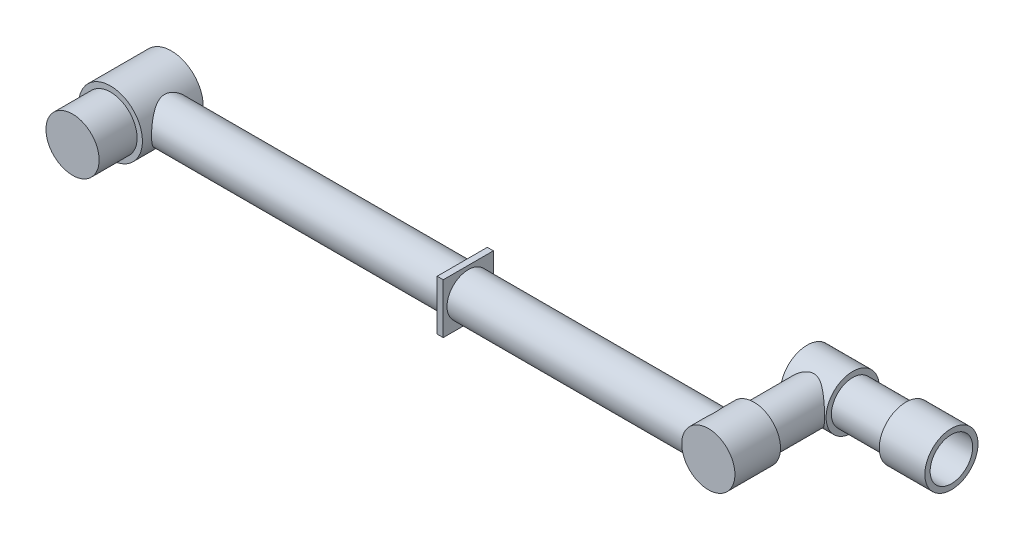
ISO-10303-21;
HEADER;
FILE_DESCRIPTION(('STEP AP214'),'2;1');
FILE_NAME('part.step','',(''),(''),'','','');
FILE_SCHEMA(('AUTOMOTIVE_DESIGN { 1 0 10303 214 1 1 1 1 }'));
ENDSEC;
DATA;
#1=APPLICATION_CONTEXT('core data for automotive mechanical design processes');
#2=APPLICATION_PROTOCOL_DEFINITION('international standard','automotive_design',2000,#1);
#3=PRODUCT_CONTEXT('',#1,'mechanical');
#4=PRODUCT('Part','Part','',(#3));
#5=PRODUCT_RELATED_PRODUCT_CATEGORY('part','',(#4));
#6=PRODUCT_DEFINITION_FORMATION('','',#4);
#7=PRODUCT_DEFINITION_CONTEXT('part definition',#1,'design');
#8=PRODUCT_DEFINITION('design','',#6,#7);
#9=PRODUCT_DEFINITION_SHAPE('','',#8);
#10=(LENGTH_UNIT() NAMED_UNIT(*) SI_UNIT(.MILLI.,.METRE.));
#11=(NAMED_UNIT(*) PLANE_ANGLE_UNIT() SI_UNIT($,.RADIAN.));
#12=(NAMED_UNIT(*) SI_UNIT($,.STERADIAN.) SOLID_ANGLE_UNIT());
#13=UNCERTAINTY_MEASURE_WITH_UNIT(LENGTH_MEASURE(1.E-05),#10,'distance_accuracy_value','');
#14=(GEOMETRIC_REPRESENTATION_CONTEXT(3) GLOBAL_UNCERTAINTY_ASSIGNED_CONTEXT((#13)) GLOBAL_UNIT_ASSIGNED_CONTEXT((#10,
#11,#12)) REPRESENTATION_CONTEXT('',''));
#15=CARTESIAN_POINT('',(0.,0.,0.));
#16=DIRECTION('',(0.,0.,1.));
#17=DIRECTION('',(1.,0.,0.));
#18=AXIS2_PLACEMENT_3D('',#15,#16,#17);
#19=CARTESIAN_POINT('',(3885.,0.,0.));
#20=DIRECTION('',(-1.,0.,0.));
#21=DIRECTION('',(0.,0.,1.));
#22=AXIS2_PLACEMENT_3D('',#19,#20,#21);
#23=CYLINDRICAL_SURFACE('',#22,140.);
#24=CARTESIAN_POINT('',(3710.,0.,140.));
#25=CARTESIAN_POINT('',(3710.00000183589,-1.68080300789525,139.999998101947));
#26=CARTESIAN_POINT('',(3710.02422893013,-3.36167422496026,139.969717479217));
#27=CARTESIAN_POINT('',(3710.12100265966,-6.72004292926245,139.848721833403));
#28=CARTESIAN_POINT('',(3710.19355607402,-8.39753991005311,139.757998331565));
#29=CARTESIAN_POINT('',(3710.38659860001,-11.7462356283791,139.51646936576));
#30=CARTESIAN_POINT('',(3710.50711028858,-13.4174310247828,139.365635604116));
#31=CARTESIAN_POINT('',(3710.79535193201,-16.7492251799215,139.004572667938));
#32=CARTESIAN_POINT('',(3710.96308017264,-18.4098243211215,138.794345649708));
#33=CARTESIAN_POINT('',(3711.34515009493,-21.7203796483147,138.314959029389));
#34=CARTESIAN_POINT('',(3711.55958061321,-23.3703092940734,138.04568710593));
#35=CARTESIAN_POINT('',(3712.03365081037,-26.6531920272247,137.449592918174));
#36=CARTESIAN_POINT('',(3712.29329097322,-28.2861449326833,137.122770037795));
#37=CARTESIAN_POINT('',(3712.85631031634,-31.5319335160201,136.412963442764));
#38=CARTESIAN_POINT('',(3713.15968374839,-33.1447718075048,136.02998710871));
#39=CARTESIAN_POINT('',(3713.8085792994,-36.3478712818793,135.209339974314));
#40=CARTESIAN_POINT('',(3714.15410128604,-37.9381325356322,134.771669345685));
#41=CARTESIAN_POINT('',(3714.8831557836,-41.0834344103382,133.846260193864));
#42=CARTESIAN_POINT('',(3715.26642757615,-42.6386364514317,133.358864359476));
#43=CARTESIAN_POINT('',(3716.07101238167,-45.7223867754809,132.333306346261));
#44=CARTESIAN_POINT('',(3716.49232909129,-47.250932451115,131.79513923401));
#45=CARTESIAN_POINT('',(3717.37097428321,-50.2791715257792,130.669865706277));
#46=CARTESIAN_POINT('',(3717.82829898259,-51.7788679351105,130.082764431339));
#47=CARTESIAN_POINT('',(3718.77701962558,-54.7480602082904,128.861271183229));
#48=CARTESIAN_POINT('',(3719.26841853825,-56.2175534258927,128.226875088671));
#49=CARTESIAN_POINT('',(3720.28302418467,-59.1243339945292,126.912790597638));
#50=CARTESIAN_POINT('',(3720.80622089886,-60.5616312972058,126.233116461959));
#51=CARTESIAN_POINT('',(3721.88251201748,-63.4034220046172,124.829954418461));
#52=CARTESIAN_POINT('',(3722.43560912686,-64.8079124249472,124.106462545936));
#53=CARTESIAN_POINT('',(3723.56956911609,-67.5830067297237,122.617359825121));
#54=CARTESIAN_POINT('',(3724.15043303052,-68.953609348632,121.851747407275));
#55=CARTESIAN_POINT('',(3725.33779860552,-71.6600682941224,120.280021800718));
#56=CARTESIAN_POINT('',(3725.94430118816,-72.9959233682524,119.473907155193));
#57=CARTESIAN_POINT('',(3727.39621243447,-76.0913887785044,117.535094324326));
#58=CARTESIAN_POINT('',(3728.25125252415,-77.8365284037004,116.386443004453));
#59=CARTESIAN_POINT('',(3729.99895414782,-81.2611345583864,114.021746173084));
#60=CARTESIAN_POINT('',(3730.89161817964,-82.9405967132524,112.805696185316));
#61=CARTESIAN_POINT('',(3732.7096385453,-86.2333082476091,110.309049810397));
#62=CARTESIAN_POINT('',(3733.63500349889,-87.8465399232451,109.028436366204));
#63=CARTESIAN_POINT('',(3735.51304529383,-91.0056433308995,106.40576831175));
#64=CARTESIAN_POINT('',(3736.46572167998,-92.5515161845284,105.06371472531));
#65=CARTESIAN_POINT('',(3738.39579242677,-95.5794864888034,102.316915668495));
#66=CARTESIAN_POINT('',(3739.37324538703,-97.0614048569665,100.912014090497));
#67=CARTESIAN_POINT('',(3741.3451837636,-99.9567992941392,98.0448335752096));
#68=CARTESIAN_POINT('',(3742.33966926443,-101.370275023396,96.5825543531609));
#69=CARTESIAN_POINT('',(3744.34014888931,-104.128324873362,93.6024225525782));
#70=CARTESIAN_POINT('',(3745.3461415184,-105.472907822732,92.0845771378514));
#71=CARTESIAN_POINT('',(3747.36416637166,-108.093069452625,88.9943375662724));
#72=CARTESIAN_POINT('',(3748.37619860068,-109.368648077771,87.4219433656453));
#73=CARTESIAN_POINT('',(3750.41625461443,-111.869836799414,84.198375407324));
#74=CARTESIAN_POINT('',(3751.44428080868,-113.094352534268,82.5463538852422));
#75=CARTESIAN_POINT('',(3753.49389236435,-115.471235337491,79.1872914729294));
#76=CARTESIAN_POINT('',(3754.51547767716,-116.623601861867,77.4802501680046));
#77=CARTESIAN_POINT('',(3756.54536686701,-118.855725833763,74.0106281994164));
#78=CARTESIAN_POINT('',(3757.5536661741,-119.935458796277,72.2480290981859));
#79=CARTESIAN_POINT('',(3759.54870835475,-122.020717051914,68.667580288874));
#80=CARTESIAN_POINT('',(3760.53545149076,-123.026243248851,66.8497312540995));
#81=CARTESIAN_POINT('',(3762.47591385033,-124.958865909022,63.1632898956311));
#82=CARTESIAN_POINT('',(3763.42971604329,-125.886169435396,61.2948500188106));
#83=CARTESIAN_POINT('',(3765.2973361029,-127.663361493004,57.5017634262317));
#84=CARTESIAN_POINT('',(3766.21115196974,-128.513246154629,55.577113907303));
#85=CARTESIAN_POINT('',(3767.98703993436,-130.132278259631,51.6725606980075));
#86=CARTESIAN_POINT('',(3768.84914836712,-130.901482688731,49.6926972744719));
#87=CARTESIAN_POINT('',(3770.50973658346,-132.356330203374,45.6767105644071));
#88=CARTESIAN_POINT('',(3771.30822779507,-133.04198830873,43.6405974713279));
#89=CARTESIAN_POINT('',(3772.94200255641,-134.422147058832,39.2028779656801));
#90=CARTESIAN_POINT('',(3773.76484711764,-135.10255475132,36.7922501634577));
#91=CARTESIAN_POINT('',(3775.28557063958,-136.340408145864,31.9006744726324));
#92=CARTESIAN_POINT('',(3775.98346941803,-136.897873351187,29.4197378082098));
#93=CARTESIAN_POINT('',(3776.91822401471,-137.635338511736,25.6543667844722));
#94=CARTESIAN_POINT('',(3777.21090552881,-137.86453674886,24.3931132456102));
#95=CARTESIAN_POINT('',(3777.75648240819,-138.289361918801,21.8564732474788));
#96=CARTESIAN_POINT('',(3778.00938189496,-138.4849923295,20.5810882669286));
#97=CARTESIAN_POINT('',(3778.4727741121,-138.84176494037,18.0177420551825));
#98=CARTESIAN_POINT('',(3778.6832638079,-139.00290467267,16.7297799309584));
#99=CARTESIAN_POINT('',(3779.05945720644,-139.289832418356,14.1433877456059));
#100=CARTESIAN_POINT('',(3779.22516084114,-139.415620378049,12.8449576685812));
#101=CARTESIAN_POINT('',(3779.5110840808,-139.632092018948,10.2282810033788));
#102=CARTESIAN_POINT('',(3779.63088179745,-139.722450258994,8.90996117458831));
#103=CARTESIAN_POINT('',(3779.82135007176,-139.865885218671,6.26774170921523));
#104=CARTESIAN_POINT('',(3779.89202064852,-139.918961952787,4.943842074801));
#105=CARTESIAN_POINT('',(3779.98330785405,-139.987491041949,2.29339302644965));
#106=CARTESIAN_POINT('',(3780.00392655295,-140.002944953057,0.966843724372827));
#107=CARTESIAN_POINT('',(3779.99484210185,-139.99613153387,-1.68598659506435));
#108=CARTESIAN_POINT('',(3779.96513888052,-139.973864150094,-3.01226761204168));
#109=CARTESIAN_POINT('',(3779.85576513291,-139.891724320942,-5.66254597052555));
#110=CARTESIAN_POINT('',(3779.77605878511,-139.83182491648,-6.98654099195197));
#111=CARTESIAN_POINT('',(3779.56768729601,-139.674780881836,-9.62843162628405));
#112=CARTESIAN_POINT('',(3779.43902236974,-139.577636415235,-10.9463272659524));
#113=CARTESIAN_POINT('',(3779.13434158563,-139.346685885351,-13.5735101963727));
#114=CARTESIAN_POINT('',(3778.95832128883,-139.212876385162,-14.882796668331));
#115=CARTESIAN_POINT('',(3778.56104749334,-138.909365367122,-17.4903193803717));
#116=CARTESIAN_POINT('',(3778.33979195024,-138.739662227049,-18.7885551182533));
#117=CARTESIAN_POINT('',(3777.81659424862,-138.335979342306,-21.5739331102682));
#118=CARTESIAN_POINT('',(3777.50744511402,-138.09609811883,-23.0588696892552));
#119=CARTESIAN_POINT('',(3776.83629937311,-137.571055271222,-26.0086403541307));
#120=CARTESIAN_POINT('',(3776.47430052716,-137.285891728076,-27.4734735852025));
#121=CARTESIAN_POINT('',(3775.70200629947,-136.671839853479,-30.381183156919));
#122=CARTESIAN_POINT('',(3775.2917068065,-136.342947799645,-31.8240576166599));
#123=CARTESIAN_POINT('',(3774.42747675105,-135.643011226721,-34.6863783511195));
#124=CARTESIAN_POINT('',(3773.97354130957,-135.271961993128,-36.1058219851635));
#125=CARTESIAN_POINT('',(3772.55103331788,-134.096026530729,-40.3339489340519));
#126=CARTESIAN_POINT('',(3771.52349006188,-133.22970975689,-43.1060520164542));
#127=CARTESIAN_POINT('',(3769.34671218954,-131.344544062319,-48.54799435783));
#128=CARTESIAN_POINT('',(3768.19746784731,-130.325682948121,-51.2178254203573));
#129=CARTESIAN_POINT('',(3766.11182496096,-128.42141115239,-55.7890107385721));
#130=CARTESIAN_POINT('',(3765.19564764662,-127.567981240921,-57.7130902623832));
#131=CARTESIAN_POINT('',(3763.32345109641,-125.783502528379,-61.505304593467));
#132=CARTESIAN_POINT('',(3762.36742787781,-124.852445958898,-63.3734337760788));
#133=CARTESIAN_POINT('',(3760.42511280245,-122.914525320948,-67.0548144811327));
#134=CARTESIAN_POINT('',(3759.43880944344,-121.907632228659,-68.8680446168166));
#135=CARTESIAN_POINT('',(3757.44504797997,-119.819938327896,-72.4393565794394));
#136=CARTESIAN_POINT('',(3756.43759048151,-118.739139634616,-74.1974399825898));
#137=CARTESIAN_POINT('',(3754.40816628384,-116.503454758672,-77.6607892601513));
#138=CARTESIAN_POINT('',(3753.38618406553,-115.348483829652,-79.3659912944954));
#139=CARTESIAN_POINT('',(3751.33600653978,-112.966394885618,-82.7213806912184));
#140=CARTESIAN_POINT('',(3750.30781119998,-111.739276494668,-84.3715677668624));
#141=CARTESIAN_POINT('',(3748.2519707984,-109.213677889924,-87.6161990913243));
#142=CARTESIAN_POINT('',(3747.22432567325,-107.91520968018,-89.2106526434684));
#143=CARTESIAN_POINT('',(3745.17556728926,-105.247124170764,-92.3432496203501));
#144=CARTESIAN_POINT('',(3744.15445404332,-103.877506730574,-93.8813929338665));
#145=CARTESIAN_POINT('',(3742.09738711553,-101.029751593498,-96.9405621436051));
#146=CARTESIAN_POINT('',(3741.06176952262,-99.5496889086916,-98.4600235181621));
#147=CARTESIAN_POINT('',(3739.00967346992,-96.5151774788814,-101.436370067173));
#148=CARTESIAN_POINT('',(3737.99319513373,-94.9607282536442,-102.893254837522));
#149=CARTESIAN_POINT('',(3735.98515081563,-91.7775386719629,-105.742359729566));
#150=CARTESIAN_POINT('',(3734.99358940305,-90.1487848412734,-107.134568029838));
#151=CARTESIAN_POINT('',(3733.04148075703,-86.817825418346,-109.851189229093));
#152=CARTESIAN_POINT('',(3732.0809327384,-85.1156216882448,-111.175603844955));
#153=CARTESIAN_POINT('',(3730.19881886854,-81.6424328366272,-113.75049796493));
#154=CARTESIAN_POINT('',(3729.27716998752,-79.8716114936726,-115.001137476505));
#155=CARTESIAN_POINT('',(3727.47638603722,-76.2586717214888,-117.42806607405));
#156=CARTESIAN_POINT('',(3726.59725199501,-74.4165515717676,-118.604353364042));
#157=CARTESIAN_POINT('',(3724.88772777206,-70.6633639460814,-120.878042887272));
#158=CARTESIAN_POINT('',(3724.057319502,-68.7523224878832,-121.975474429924));
#159=CARTESIAN_POINT('',(3722.45083404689,-64.8628910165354,-124.087474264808));
#160=CARTESIAN_POINT('',(3721.67475168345,-62.8845074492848,-125.102050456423));
#161=CARTESIAN_POINT('',(3720.39735514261,-59.4416008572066,-126.764452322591));
#162=CARTESIAN_POINT('',(3719.88120993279,-57.9929296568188,-127.433836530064));
#163=CARTESIAN_POINT('',(3718.88155666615,-55.0641143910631,-128.726474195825));
#164=CARTESIAN_POINT('',(3718.3980470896,-53.5839717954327,-129.349729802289));
#165=CARTESIAN_POINT('',(3717.4657836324,-50.5938587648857,-130.548287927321));
#166=CARTESIAN_POINT('',(3717.0170252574,-49.0838922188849,-131.123596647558));
#167=CARTESIAN_POINT('',(3716.15619958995,-46.0356301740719,-132.224607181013));
#168=CARTESIAN_POINT('',(3715.74413276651,-44.4973343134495,-132.75030836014));
#169=CARTESIAN_POINT('',(3714.95884242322,-41.3952087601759,-133.750106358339));
#170=CARTESIAN_POINT('',(3714.58559859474,-39.8313929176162,-134.224230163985));
#171=CARTESIAN_POINT('',(3713.87954157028,-36.6796488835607,-135.119528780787));
#172=CARTESIAN_POINT('',(3713.5467282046,-35.0917207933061,-135.540703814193));
#173=CARTESIAN_POINT('',(3712.92322049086,-31.8941273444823,-136.328559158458));
#174=CARTESIAN_POINT('',(3712.63252800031,-30.2844610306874,-136.695237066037));
#175=CARTESIAN_POINT('',(3712.09482474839,-27.0461508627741,-137.372639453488));
#176=CARTESIAN_POINT('',(3711.84781405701,-25.4175069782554,-137.683363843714));
#177=CARTESIAN_POINT('',(3711.39764357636,-22.1354889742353,-138.249078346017));
#178=CARTESIAN_POINT('',(3711.19472300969,-20.4820295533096,-138.503764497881));
#179=CARTESIAN_POINT('',(3710.83556110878,-17.1620513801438,-138.954201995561));
#180=CARTESIAN_POINT('',(3710.6793198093,-15.495532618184,-139.149953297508));
#181=CARTESIAN_POINT('',(3710.41442986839,-12.1527672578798,-139.481652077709));
#182=CARTESIAN_POINT('',(3710.30578157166,-10.4765205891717,-139.617599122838));
#183=CARTESIAN_POINT('',(3710.13672644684,-7.11779098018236,-139.82906877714));
#184=CARTESIAN_POINT('',(3710.07631954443,-5.43530804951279,-139.904591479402));
#185=CARTESIAN_POINT('',(3710.00411571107,-2.06790525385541,-139.994857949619));
#186=CARTESIAN_POINT('',(3709.9923119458,-0.382985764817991,-140.0096102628));
#187=CARTESIAN_POINT('',(3710.01736723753,2.98593306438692,-139.978290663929));
#188=CARTESIAN_POINT('',(3710.0542265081,4.66993240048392,-139.932218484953));
#189=CARTESIAN_POINT('',(3710.17638210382,8.03332891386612,-139.779467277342));
#190=CARTESIAN_POINT('',(3710.26167604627,9.71272631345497,-139.672791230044));
#191=CARTESIAN_POINT('',(3710.48018855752,13.0634643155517,-139.399323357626));
#192=CARTESIAN_POINT('',(3710.61340633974,14.7348050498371,-139.232532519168));
#193=CARTESIAN_POINT('',(3710.91423875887,17.9307163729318,-138.855551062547));
#194=CARTESIAN_POINT('',(3711.07818086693,19.4561822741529,-138.649985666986));
#195=CARTESIAN_POINT('',(3711.44505171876,22.4949334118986,-138.18950554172));
#196=CARTESIAN_POINT('',(3711.64798058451,24.0082186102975,-137.934590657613));
#197=CARTESIAN_POINT('',(3712.09183786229,27.0200742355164,-137.376348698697));
#198=CARTESIAN_POINT('',(3712.33276323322,28.518645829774,-137.073025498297));
#199=CARTESIAN_POINT('',(3712.8515085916,31.4989649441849,-136.418997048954));
#200=CARTESIAN_POINT('',(3713.12932877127,32.9807123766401,-136.068291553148));
#201=CARTESIAN_POINT('',(3713.72065586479,35.9255061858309,-135.320604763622));
#202=CARTESIAN_POINT('',(3714.03416779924,37.3885498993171,-134.923616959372));
#203=CARTESIAN_POINT('',(3714.69551221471,40.2939365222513,-134.084619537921));
#204=CARTESIAN_POINT('',(3715.04334737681,41.7362778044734,-133.642606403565));
#205=CARTESIAN_POINT('',(3715.77185132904,44.5983651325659,-132.714915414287));
#206=CARTESIAN_POINT('',(3716.15251872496,46.0181121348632,-132.229239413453));
#207=CARTESIAN_POINT('',(3716.94520553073,48.833649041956,-131.21552406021));
#208=CARTESIAN_POINT('',(3717.35722769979,50.2294368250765,-130.687480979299));
#209=CARTESIAN_POINT('',(3718.23735307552,53.0808895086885,-129.556606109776));
#210=CARTESIAN_POINT('',(3718.70734776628,54.5349393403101,-128.951170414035));
#211=CARTESIAN_POINT('',(3719.67893428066,57.4130042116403,-127.695781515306));
#212=CARTESIAN_POINT('',(3720.18052889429,58.8370165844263,-127.045824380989));
#213=CARTESIAN_POINT('',(3721.72969205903,63.0618822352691,-125.031720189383));
#214=CARTESIAN_POINT('',(3722.8218175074,65.8161354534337,-123.603112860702));
#215=CARTESIAN_POINT('',(3725.10825651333,71.1910277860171,-120.587462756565));
#216=CARTESIAN_POINT('',(3726.30255779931,73.8116828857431,-119.000439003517));
#217=CARTESIAN_POINT('',(3728.77761104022,78.9151973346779,-115.679129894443));
#218=CARTESIAN_POINT('',(3730.05836797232,81.3980487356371,-113.944836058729));
#219=CARTESIAN_POINT('',(3732.93943625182,86.6790821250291,-109.998021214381));
#220=CARTESIAN_POINT('',(3734.55436558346,89.4480661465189,-107.757096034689));
#221=CARTESIAN_POINT('',(3737.8575774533,94.7837127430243,-103.095107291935));
#222=CARTESIAN_POINT('',(3739.54586835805,97.3503521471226,-100.674023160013));
#223=CARTESIAN_POINT('',(3742.11485528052,101.04998778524,-96.9123528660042));
#224=CARTESIAN_POINT('',(3742.97855288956,102.259787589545,-95.6348447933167));
#225=CARTESIAN_POINT('',(3744.71400531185,104.627883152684,-93.0381307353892));
#226=CARTESIAN_POINT('',(3745.58576008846,105.786179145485,-91.7189249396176));
#227=CARTESIAN_POINT('',(3747.3336507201,108.051018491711,-89.0396237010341));
#228=CARTESIAN_POINT('',(3748.2097866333,109.157561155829,-87.6795277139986));
#229=CARTESIAN_POINT('',(3749.9626175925,111.318646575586,-84.9189711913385));
#230=CARTESIAN_POINT('',(3750.83931264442,112.37318877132,-83.5185102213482));
#231=CARTESIAN_POINT('',(3752.77606160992,114.649528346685,-80.3742176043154));
#232=CARTESIAN_POINT('',(3753.83530085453,115.858966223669,-78.6209125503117));
#233=CARTESIAN_POINT('',(3755.94090701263,118.199953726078,-75.0554421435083));
#234=CARTESIAN_POINT('',(3756.98727343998,119.331500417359,-73.2432745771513));
#235=CARTESIAN_POINT('',(3759.0590921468,121.516068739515,-69.558855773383));
#236=CARTESIAN_POINT('',(3760.08453256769,122.569046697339,-67.686571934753));
#237=CARTESIAN_POINT('',(3762.10427233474,124.594080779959,-63.8823773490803));
#238=CARTESIAN_POINT('',(3763.09857241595,125.566138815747,-61.950468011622));
#239=CARTESIAN_POINT('',(3765.04183856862,127.423859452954,-58.0331176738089));
#240=CARTESIAN_POINT('',(3765.99095048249,128.309811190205,-56.047886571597));
#241=CARTESIAN_POINT('',(3767.83545688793,129.996274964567,-52.0167508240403));
#242=CARTESIAN_POINT('',(3768.7308476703,130.79678110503,-49.9708420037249));
#243=CARTESIAN_POINT('',(3770.45326960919,132.307814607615,-45.8204505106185));
#244=CARTESIAN_POINT('',(3771.28037042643,133.01843406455,-43.7160305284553));
#245=CARTESIAN_POINT('',(3772.85181180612,134.345978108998,-39.4480909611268));
#246=CARTESIAN_POINT('',(3773.59617302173,134.962926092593,-37.2845862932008));
#247=CARTESIAN_POINT('',(3775.03901720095,136.141529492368,-32.7325797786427));
#248=CARTESIAN_POINT('',(3775.72966024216,136.695368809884,-30.3395098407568));
#249=CARTESIAN_POINT('',(3776.66341267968,137.434861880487,-26.705579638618));
#250=CARTESIAN_POINT('',(3776.95763636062,137.666154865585,-25.4868400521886));
#251=CARTESIAN_POINT('',(3777.50946075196,138.097453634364,-23.0356519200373));
#252=CARTESIAN_POINT('',(3777.76706503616,138.297462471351,-21.8032047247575));
#253=CARTESIAN_POINT('',(3778.24269008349,138.664944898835,-19.3285945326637));
#254=CARTESIAN_POINT('',(3778.46079224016,138.832485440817,-18.0864571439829));
#255=CARTESIAN_POINT('',(3778.85581774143,139.134734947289,-15.5917908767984));
#256=CARTESIAN_POINT('',(3779.03274538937,139.269447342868,-14.3392630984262));
#257=CARTESIAN_POINT('',(3779.34352814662,139.505369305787,-11.8256294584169));
#258=CARTESIAN_POINT('',(3779.47738029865,139.606576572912,-10.5645230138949));
#259=CARTESIAN_POINT('',(3779.7004607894,139.774914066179,-8.03608687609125));
#260=CARTESIAN_POINT('',(3779.78968906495,139.842044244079,-6.76875717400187));
#261=CARTESIAN_POINT('',(3779.9228234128,139.942109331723,-4.22339710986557));
#262=CARTESIAN_POINT('',(3779.96647884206,139.974855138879,-2.94534613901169));
#263=CARTESIAN_POINT('',(3780.00706627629,140.005301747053,-0.388083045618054));
#264=CARTESIAN_POINT('',(3780.00399829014,140.003002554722,0.891129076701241));
#265=CARTESIAN_POINT('',(3779.95117757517,139.963373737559,3.44801205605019));
#266=CARTESIAN_POINT('',(3779.9014259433,139.926044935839,4.72568294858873));
#267=CARTESIAN_POINT('',(3779.75584923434,139.816583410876,7.27689534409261));
#268=CARTESIAN_POINT('',(3779.6600240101,139.744450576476,8.55043683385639));
#269=CARTESIAN_POINT('',(3779.42328667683,139.56568201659,11.0926238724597));
#270=CARTESIAN_POINT('',(3779.28231363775,139.458999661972,12.3612604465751));
#271=CARTESIAN_POINT('',(3778.95695006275,139.211756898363,14.8896007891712));
#272=CARTESIAN_POINT('',(3778.77255982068,139.071196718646,16.1493046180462));
#273=CARTESIAN_POINT('',(3778.36236189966,138.756912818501,18.6579008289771));
#274=CARTESIAN_POINT('',(3778.13654995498,138.583185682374,19.9067920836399));
#275=CARTESIAN_POINT('',(3777.64584517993,138.2034067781,22.3919340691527));
#276=CARTESIAN_POINT('',(3777.38095030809,137.997353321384,23.6281841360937));
#277=CARTESIAN_POINT('',(3776.7369557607,137.492993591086,26.4236469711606));
#278=CARTESIAN_POINT('',(3776.34645589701,137.184882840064,27.9784852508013));
#279=CARTESIAN_POINT('',(3775.51165751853,136.519551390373,31.062878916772));
#280=CARTESIAN_POINT('',(3775.0673552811,136.162327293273,32.5924325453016));
#281=CARTESIAN_POINT('',(3773.6618872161,135.019556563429,37.1415422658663));
#282=CARTESIAN_POINT('',(3772.62817202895,134.162920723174,40.1214965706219));
#283=CARTESIAN_POINT('',(3770.96436440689,132.745650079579,44.5080209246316));
#284=CARTESIAN_POINT('',(3770.39007259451,132.250446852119,45.9581167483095));
#285=CARTESIAN_POINT('',(3769.20873332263,131.217368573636,48.8295946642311));
#286=CARTESIAN_POINT('',(3768.60168660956,130.679494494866,50.2509774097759));
#287=CARTESIAN_POINT('',(3767.35951773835,129.562397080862,53.0648387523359));
#288=CARTESIAN_POINT('',(3766.72439564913,128.983173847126,54.457317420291));
#289=CARTESIAN_POINT('',(3765.43029691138,127.784444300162,57.2135842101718));
#290=CARTESIAN_POINT('',(3764.77131929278,127.164936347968,58.5773711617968));
#291=CARTESIAN_POINT('',(3763.12974557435,125.596376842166,61.8891323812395));
#292=CARTESIAN_POINT('',(3762.13603994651,124.625392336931,63.8212593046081));
#293=CARTESIAN_POINT('',(3760.11736407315,122.602486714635,67.6259765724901));
#294=CARTESIAN_POINT('',(3759.09239111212,121.550558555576,69.4985617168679));
#295=CARTESIAN_POINT('',(3757.02047433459,119.367109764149,73.1852744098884));
#296=CARTESIAN_POINT('',(3755.97352302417,118.235561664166,74.999381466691));
#297=CARTESIAN_POINT('',(3753.86664514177,115.894449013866,78.5686428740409));
#298=CARTESIAN_POINT('',(3752.80671889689,114.684886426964,80.3237987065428));
#299=CARTESIAN_POINT('',(3750.68065814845,112.187372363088,83.7767137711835));
#300=CARTESIAN_POINT('',(3749.61451868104,110.899347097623,85.4744165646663));
#301=CARTESIAN_POINT('',(3747.48424654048,108.246531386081,88.8100748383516));
#302=CARTESIAN_POINT('',(3746.42011387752,106.881740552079,90.4480300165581));
#303=CARTESIAN_POINT('',(3744.30077389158,104.07602174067,93.662867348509));
#304=CARTESIAN_POINT('',(3743.24556524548,102.635105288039,95.2397586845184));
#305=CARTESIAN_POINT('',(3741.15033734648,99.6772758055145,98.3311597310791));
#306=CARTESIAN_POINT('',(3740.11031809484,98.1603627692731,99.8456694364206));
#307=CARTESIAN_POINT('',(3738.03803592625,95.0302616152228,102.829892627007));
#308=CARTESIAN_POINT('',(3737.00605845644,93.4160640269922,104.298746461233));
#309=CARTESIAN_POINT('',(3734.97040610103,90.1104254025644,107.167628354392));
#310=CARTESIAN_POINT('',(3733.96673135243,88.418983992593,108.567656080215));
#311=CARTESIAN_POINT('',(3731.9937680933,84.959163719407,111.295978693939));
#312=CARTESIAN_POINT('',(3731.02448660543,83.190769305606,112.624258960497));
#313=CARTESIAN_POINT('',(3729.12681615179,79.5783457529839,115.205096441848));
#314=CARTESIAN_POINT('',(3728.19842676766,77.7343173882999,116.457654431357));
#315=CARTESIAN_POINT('',(3726.39100047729,73.9764950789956,118.880037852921));
#316=CARTESIAN_POINT('',(3725.51185112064,72.0628780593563,120.050053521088));
#317=CARTESIAN_POINT('',(3723.8067909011,68.163605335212,122.306158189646));
#318=CARTESIAN_POINT('',(3722.98088168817,66.1779474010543,123.39224458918));
#319=CARTESIAN_POINT('',(3721.38906204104,62.1383276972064,125.475056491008));
#320=CARTESIAN_POINT('',(3720.62312089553,60.084401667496,126.471827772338));
#321=CARTESIAN_POINT('',(3719.15708716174,55.9108094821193,128.37147896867));
#322=CARTESIAN_POINT('',(3718.45698634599,53.791151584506,129.274370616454));
#323=CARTESIAN_POINT('',(3717.34579528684,50.1932664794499,130.702189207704));
#324=CARTESIAN_POINT('',(3716.91502250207,48.7317803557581,131.254212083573));
#325=CARTESIAN_POINT('',(3716.08787517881,45.7825203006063,132.311808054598));
#326=CARTESIAN_POINT('',(3715.69149906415,44.2947475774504,132.817383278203));
#327=CARTESIAN_POINT('',(3714.93489929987,41.2947290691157,133.78051897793));
#328=CARTESIAN_POINT('',(3714.57467426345,39.7824842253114,134.23808129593));
#329=CARTESIAN_POINT('',(3713.89200729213,36.7354378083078,135.103723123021));
#330=CARTESIAN_POINT('',(3713.56956561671,35.200636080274,135.511802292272));
#331=CARTESIAN_POINT('',(3712.9646904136,32.1141671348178,136.276198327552));
#332=CARTESIAN_POINT('',(3712.68216880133,30.5625454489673,136.632629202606));
#333=CARTESIAN_POINT('',(3712.15767749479,27.4414914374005,137.293513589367));
#334=CARTESIAN_POINT('',(3711.91570711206,25.8720594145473,137.597967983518));
#335=CARTESIAN_POINT('',(3711.47362757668,22.71854351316,138.15364725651));
#336=CARTESIAN_POINT('',(3711.27350325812,21.134465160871,138.404891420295));
#337=CARTESIAN_POINT('',(3710.91607515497,17.9540323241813,138.853272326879));
#338=CARTESIAN_POINT('',(3710.75876603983,16.3576793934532,139.050415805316));
#339=CARTESIAN_POINT('',(3710.51983764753,13.5343266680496,139.349679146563));
#340=CARTESIAN_POINT('',(3710.42911628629,12.3092898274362,139.463245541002));
#341=CARTESIAN_POINT('',(3710.27340129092,9.85529393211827,139.658110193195));
#342=CARTESIAN_POINT('',(3710.20840165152,8.62633586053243,139.739415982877));
#343=CARTESIAN_POINT('',(3710.10430044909,6.16534044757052,139.869608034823));
#344=CARTESIAN_POINT('',(3710.06520446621,4.93330250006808,139.918487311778));
#345=CARTESIAN_POINT('',(3710.01305029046,2.46752218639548,139.983688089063));
#346=CARTESIAN_POINT('',(3709.99999865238,1.23377946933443,140.00000139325));
#347=CARTESIAN_POINT('',(3710.,0.,140.));
#348=B_SPLINE_CURVE_WITH_KNOTS('',3,(#24,#25,#26,#27,#28,#29,#30,#31,#32,#33,#34,#35,#36,#37,
#38,#39,#40,#41,#42,#43,#44,#45,#46,#47,#48,#49,#50,#51,#52,#53,#54,#55,#56,#57,#58,#59,#60,#61,
#62,#63,#64,#65,#66,#67,#68,#69,#70,#71,#72,#73,#74,#75,#76,#77,#78,#79,#80,#81,#82,#83,#84,#85,
#86,#87,#88,#89,#90,#91,#92,#93,#94,#95,#96,#97,#98,#99,#100,#101,#102,#103,#104,#105,#106,#107,
#108,#109,#110,#111,#112,#113,#114,#115,#116,#117,#118,#119,#120,#121,#122,#123,#124,#125,#126,
#127,#128,#129,#130,#131,#132,#133,#134,#135,#136,#137,#138,#139,#140,#141,#142,#143,#144,#145,
#146,#147,#148,#149,#150,#151,#152,#153,#154,#155,#156,#157,#158,#159,#160,#161,#162,#163,#164,
#165,#166,#167,#168,#169,#170,#171,#172,#173,#174,#175,#176,#177,#178,#179,#180,#181,#182,#183,
#184,#185,#186,#187,#188,#189,#190,#191,#192,#193,#194,#195,#196,#197,#198,#199,#200,#201,#202,
#203,#204,#205,#206,#207,#208,#209,#210,#211,#212,#213,#214,#215,#216,#217,#218,#219,#220,#221,
#222,#223,#224,#225,#226,#227,#228,#229,#230,#231,#232,#233,#234,#235,#236,#237,#238,#239,#240,
#241,#242,#243,#244,#245,#246,#247,#248,#249,#250,#251,#252,#253,#254,#255,#256,#257,#258,#259,
#260,#261,#262,#263,#264,#265,#266,#267,#268,#269,#270,#271,#272,#273,#274,#275,#276,#277,#278,
#279,#280,#281,#282,#283,#284,#285,#286,#287,#288,#289,#290,#291,#292,#293,#294,#295,#296,#297,
#298,#299,#300,#301,#302,#303,#304,#305,#306,#307,#308,#309,#310,#311,#312,#313,#314,#315,#316,
#317,#318,#319,#320,#321,#322,#323,#324,#325,#326,#327,#328,#329,#330,#331,#332,#333,#334,#335,
#336,#337,#338,#339,#340,#341,#342,#343,#344,#345,#346,#347),.UNSPECIFIED.,.T.,.F.,(4,2,2,2,2,2,
2,2,2,2,2,2,2,2,2,2,2,2,2,2,2,2,2,2,2,2,2,2,2,2,2,2,2,2,2,2,2,2,2,2,2,2,2,2,2,2,2,2,2,2,2,2,2,2,
2,2,2,2,2,2,2,2,2,2,2,2,2,2,2,2,2,2,2,2,2,2,2,2,2,2,2,2,2,2,2,2,2,2,2,2,2,2,2,2,2,2,2,2,2,2,2,2,
2,2,2,2,2,2,2,2,2,2,2,2,2,2,2,2,2,2,2,2,2,2,2,2,2,2,2,2,2,2,2,2,2,2,2,2,2,2,2,2,2,2,2,2,2,2,2,2,
2,2,2,2,2,2,2,2,2,2,2,4),(0.,5.04208097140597,10.0848693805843,15.1300345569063,
20.1750165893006,25.2296802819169,30.284398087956,35.3384521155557,40.3924902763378,
45.4137899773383,50.4355780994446,55.4568393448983,60.4785386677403,65.4986637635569,
70.519243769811,75.5400109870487,80.5609589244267,87.330784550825,94.1010603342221,
100.873134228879,107.645095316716,114.434928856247,121.224796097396,128.013791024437,
134.80279139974,141.698034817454,148.593330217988,155.490938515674,162.388462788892,
169.26711482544,176.146110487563,183.020214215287,189.89308029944,197.796597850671,
205.698860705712,209.642636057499,213.586002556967,217.52965111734,221.473305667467,
225.452380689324,229.431454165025,233.41036306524,237.389277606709,241.371045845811,
245.352796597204,249.334920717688,253.31722484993,257.922261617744,262.527493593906,
267.133117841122,271.739257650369,280.971710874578,290.204902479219,297.08939751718,
303.974582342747,310.862415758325,317.750052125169,324.645703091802,331.541389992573,
338.435920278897,345.330464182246,352.409852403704,359.489286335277,366.57000917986,
373.650552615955,380.71512750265,387.779872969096,394.841978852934,401.903410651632,
406.933990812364,411.964336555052,416.994030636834,422.023789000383,427.050902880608,
432.077995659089,437.105310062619,442.132632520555,447.186586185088,452.240543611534,
457.294537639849,462.348523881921,467.401799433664,472.455097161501,477.508146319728,
482.561112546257,487.203675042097,491.846252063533,496.488457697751,501.130687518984,
505.773571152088,510.41681774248,515.059867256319,519.703325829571,524.633115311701,
529.563340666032,539.421875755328,549.279228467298,559.137149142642,570.859884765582,
582.58396084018,588.463044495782,594.342101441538,600.221236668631,606.100435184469,
613.234844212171,620.369521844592,627.508136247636,634.646582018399,641.760163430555,
648.874235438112,655.980958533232,663.085903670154,670.733222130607,674.557140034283,
678.38068449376,682.196258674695,686.011433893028,689.826870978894,693.642313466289,
697.478631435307,701.314948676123,705.151175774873,708.987415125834,712.828853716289,
716.670266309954,720.51207472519,724.354083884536,729.249383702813,734.145022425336,
743.936457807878,748.844895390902,753.753221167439,758.661534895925,763.570048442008,
770.70680256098,777.844178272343,784.984028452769,792.123699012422,799.270190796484,
806.416718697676,813.562167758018,820.707617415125,827.947761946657,835.187941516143,
842.429591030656,849.671166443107,856.895466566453,864.119990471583,871.340789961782,
878.560685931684,883.421266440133,888.281624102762,893.141795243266,898.00199976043,
902.851306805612,907.700531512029,912.547995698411,917.394856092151,921.095090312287,
924.794460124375,928.494626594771,932.195724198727),.UNSPECIFIED.);
#349=CARTESIAN_POINT('',(3710.,0.,140.));
#350=VERTEX_POINT('',#349);
#351=EDGE_CURVE('E145',#350,#350,#348,.T.);
#352=ORIENTED_EDGE('',*,*,#351,.F.);
#353=EDGE_LOOP('',(#352));
#354=FACE_BOUND('',#353,.T.);
#355=CARTESIAN_POINT('',(2155.,0.,0.));
#356=DIRECTION('',(-1.,0.,0.));
#357=DIRECTION('',(0.,0.,1.));
#358=AXIS2_PLACEMENT_3D('',#355,#356,#357);
#359=CIRCLE('',#358,140.);
#360=CARTESIAN_POINT('',(2155.,0.,140.));
#361=VERTEX_POINT('',#360);
#362=EDGE_CURVE('E11',#361,#361,#359,.T.);
#363=ORIENTED_EDGE('',*,*,#362,.F.);
#364=EDGE_LOOP('',(#363));
#365=FACE_BOUND('',#364,.T.);
#366=ADVANCED_FACE('F40',(#354,#365),#23,.T.);
#367=CARTESIAN_POINT('',(4535.,0.,-650.));
#368=DIRECTION('',(-1.,0.,0.));
#369=DIRECTION('',(0.,0.,1.));
#370=AXIS2_PLACEMENT_3D('',#367,#368,#369);
#371=CYLINDRICAL_SURFACE('',#370,140.);
#372=CARTESIAN_POINT('',(4035.,0.,-650.));
#373=DIRECTION('',(1.,0.,0.));
#374=DIRECTION('',(0.,0.,-1.));
#375=AXIS2_PLACEMENT_3D('',#372,#373,#374);
#376=CIRCLE('',#375,140.);
#377=CARTESIAN_POINT('',(4035.,0.,-790.));
#378=VERTEX_POINT('',#377);
#379=EDGE_CURVE('E132',#378,#378,#376,.T.);
#380=ORIENTED_EDGE('',*,*,#379,.T.);
#381=EDGE_LOOP('',(#380));
#382=FACE_BOUND('',#381,.T.);
#383=CARTESIAN_POINT('',(4385.,0.,-650.));
#384=DIRECTION('',(1.,0.,0.));
#385=DIRECTION('',(0.,0.,-1.));
#386=AXIS2_PLACEMENT_3D('',#383,#384,#385);
#387=CIRCLE('',#386,140.);
#388=CARTESIAN_POINT('',(4385.,0.,-790.));
#389=VERTEX_POINT('',#388);
#390=EDGE_CURVE('E50',#389,#389,#387,.T.);
#391=ORIENTED_EDGE('',*,*,#390,.F.);
#392=EDGE_LOOP('',(#391));
#393=FACE_BOUND('',#392,.T.);
#394=ADVANCED_FACE('F206',(#382,#393),#371,.T.);
#395=CARTESIAN_POINT('',(3885.,0.,-650.));
#396=DIRECTION('',(0.,0.,1.));
#397=DIRECTION('',(1.,0.,0.));
#398=AXIS2_PLACEMENT_3D('',#395,#396,#397);
#399=CYLINDRICAL_SURFACE('',#398,140.);
#400=CARTESIAN_POINT('',(3885.,0.,-150.));
#401=DIRECTION('',(0.,0.,-1.));
#402=DIRECTION('',(-1.,0.,0.));
#403=AXIS2_PLACEMENT_3D('',#400,#401,#402);
#404=CIRCLE('',#403,140.);
#405=CARTESIAN_POINT('',(3745.,0.,-150.));
#406=VERTEX_POINT('',#405);
#407=EDGE_CURVE('E142',#406,#406,#404,.T.);
#408=ORIENTED_EDGE('',*,*,#407,.T.);
#409=EDGE_LOOP('',(#408));
#410=FACE_BOUND('',#409,.T.);
#411=CARTESIAN_POINT('',(4025.,0.,-475.));
#412=CARTESIAN_POINT('',(4024.99999810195,-1.68080300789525,-475.000001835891));
#413=CARTESIAN_POINT('',(4024.96971747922,-3.36167422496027,-475.024228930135));
#414=CARTESIAN_POINT('',(4024.8487218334,-6.72004292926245,-475.121002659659));
#415=CARTESIAN_POINT('',(4024.75799833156,-8.39753991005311,-475.193556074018));
#416=CARTESIAN_POINT('',(4024.51646936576,-11.7462356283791,-475.38659860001));
#417=CARTESIAN_POINT('',(4024.36563560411,-13.4174310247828,-475.507110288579));
#418=CARTESIAN_POINT('',(4024.00457266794,-16.7492251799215,-475.795351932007));
#419=CARTESIAN_POINT('',(4023.79434564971,-18.4098243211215,-475.963080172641));
#420=CARTESIAN_POINT('',(4023.31495902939,-21.7203796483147,-476.345150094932));
#421=CARTESIAN_POINT('',(4023.04568710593,-23.3703092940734,-476.559580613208));
#422=CARTESIAN_POINT('',(4022.44959291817,-26.6531920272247,-477.033650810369));
#423=CARTESIAN_POINT('',(4022.12277003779,-28.2861449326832,-477.293290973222));
#424=CARTESIAN_POINT('',(4021.41296344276,-31.53193351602,-477.856310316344));
#425=CARTESIAN_POINT('',(4021.02998710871,-33.1447718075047,-478.15968374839));
#426=CARTESIAN_POINT('',(4020.20933997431,-36.3478712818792,-478.808579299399));
#427=CARTESIAN_POINT('',(4019.77166934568,-37.9381325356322,-479.154101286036));
#428=CARTESIAN_POINT('',(4018.84626019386,-41.0834344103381,-479.883155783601));
#429=CARTESIAN_POINT('',(4018.35886435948,-42.6386364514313,-480.266427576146));
#430=CARTESIAN_POINT('',(4017.33330634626,-45.7223867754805,-481.07101238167));
#431=CARTESIAN_POINT('',(4016.79513923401,-47.2509324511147,-481.492329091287));
#432=CARTESIAN_POINT('',(4015.66986570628,-50.279171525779,-482.370974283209));
#433=CARTESIAN_POINT('',(4015.08276443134,-51.7788679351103,-482.828298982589));
#434=CARTESIAN_POINT('',(4013.86127118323,-54.7480602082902,-483.777019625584));
#435=CARTESIAN_POINT('',(4013.22687508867,-56.2175534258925,-484.268418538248));
#436=CARTESIAN_POINT('',(4011.91279059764,-59.1243339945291,-485.28302418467));
#437=CARTESIAN_POINT('',(4011.23311646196,-60.5616312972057,-485.806220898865));
#438=CARTESIAN_POINT('',(4009.82995441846,-63.403422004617,-486.882512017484));
#439=CARTESIAN_POINT('',(4009.10646254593,-64.8079124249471,-487.435609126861));
#440=CARTESIAN_POINT('',(4007.61735982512,-67.5830067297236,-488.569569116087));
#441=CARTESIAN_POINT('',(4006.85174740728,-68.9536093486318,-489.150433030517));
#442=CARTESIAN_POINT('',(4005.28002180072,-71.6600682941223,-490.33779860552));
#443=CARTESIAN_POINT('',(4004.47390715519,-72.9959233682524,-490.944301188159));
#444=CARTESIAN_POINT('',(4002.53509432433,-76.0913887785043,-492.396212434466));
#445=CARTESIAN_POINT('',(4001.38644300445,-77.8365284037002,-493.251252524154));
#446=CARTESIAN_POINT('',(3999.02174617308,-81.2611345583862,-494.99895414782));
#447=CARTESIAN_POINT('',(3997.80569618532,-82.9405967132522,-495.89161817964));
#448=CARTESIAN_POINT('',(3995.3090498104,-86.2333082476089,-497.709638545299));
#449=CARTESIAN_POINT('',(3994.0284363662,-87.8465399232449,-498.635003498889));
#450=CARTESIAN_POINT('',(3991.40576831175,-91.0056433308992,-500.513045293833));
#451=CARTESIAN_POINT('',(3990.06371472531,-92.5515161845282,-501.465721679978));
#452=CARTESIAN_POINT('',(3987.3169156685,-95.5794864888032,-503.395792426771));
#453=CARTESIAN_POINT('',(3985.9120140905,-97.0614048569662,-504.373245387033));
#454=CARTESIAN_POINT('',(3983.04483357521,-99.9567992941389,-506.345183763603));
#455=CARTESIAN_POINT('',(3981.58255435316,-101.370275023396,-507.339669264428));
#456=CARTESIAN_POINT('',(3978.60242255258,-104.128324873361,-509.340148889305));
#457=CARTESIAN_POINT('',(3977.08457713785,-105.472907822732,-510.346141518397));
#458=CARTESIAN_POINT('',(3973.99433756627,-108.093069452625,-512.364166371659));
#459=CARTESIAN_POINT('',(3972.42194336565,-109.36864807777,-513.376198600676));
#460=CARTESIAN_POINT('',(3969.19837540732,-111.869836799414,-515.416254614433));
#461=CARTESIAN_POINT('',(3967.54635388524,-113.094352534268,-516.444280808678));
#462=CARTESIAN_POINT('',(3964.18729147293,-115.471235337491,-518.493892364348));
#463=CARTESIAN_POINT('',(3962.480250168,-116.623601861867,-519.515477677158));
#464=CARTESIAN_POINT('',(3959.01062819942,-118.855725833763,-521.545366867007));
#465=CARTESIAN_POINT('',(3957.24802909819,-119.935458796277,-522.553666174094));
#466=CARTESIAN_POINT('',(3953.66758028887,-122.020717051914,-524.54870835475));
#467=CARTESIAN_POINT('',(3951.8497312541,-123.026243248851,-525.535451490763));
#468=CARTESIAN_POINT('',(3948.16328989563,-124.958865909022,-527.47591385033));
#469=CARTESIAN_POINT('',(3946.29485001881,-125.886169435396,-528.429716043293));
#470=CARTESIAN_POINT('',(3942.50176342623,-127.663361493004,-530.297336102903));
#471=CARTESIAN_POINT('',(3940.5771139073,-128.513246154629,-531.211151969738));
#472=CARTESIAN_POINT('',(3936.67256069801,-130.132278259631,-532.987039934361));
#473=CARTESIAN_POINT('',(3934.69269727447,-130.901482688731,-533.849148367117));
#474=CARTESIAN_POINT('',(3930.67671056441,-132.356330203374,-535.509736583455));
#475=CARTESIAN_POINT('',(3928.64059747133,-133.04198830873,-536.308227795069));
#476=CARTESIAN_POINT('',(3924.20287796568,-134.422147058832,-537.942002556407));
#477=CARTESIAN_POINT('',(3921.79225016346,-135.10255475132,-538.76484711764));
#478=CARTESIAN_POINT('',(3916.90067447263,-136.340408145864,-540.285570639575));
#479=CARTESIAN_POINT('',(3914.41973780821,-136.897873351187,-540.983469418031));
#480=CARTESIAN_POINT('',(3910.65436678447,-137.635338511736,-541.918224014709));
#481=CARTESIAN_POINT('',(3909.39311324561,-137.86453674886,-542.210905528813));
#482=CARTESIAN_POINT('',(3906.85647324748,-138.2893619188,-542.756482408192));
#483=CARTESIAN_POINT('',(3905.58108826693,-138.4849923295,-543.009381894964));
#484=CARTESIAN_POINT('',(3903.01774205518,-138.84176494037,-543.4727741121));
#485=CARTESIAN_POINT('',(3901.72977993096,-139.002904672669,-543.683263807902));
#486=CARTESIAN_POINT('',(3899.14338774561,-139.289832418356,-544.059457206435));
#487=CARTESIAN_POINT('',(3897.84495766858,-139.415620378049,-544.225160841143));
#488=CARTESIAN_POINT('',(3895.22828100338,-139.632092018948,-544.511084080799));
#489=CARTESIAN_POINT('',(3893.90996117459,-139.722450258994,-544.630881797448));
#490=CARTESIAN_POINT('',(3891.26774170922,-139.86588521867,-544.821350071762));
#491=CARTESIAN_POINT('',(3889.9438420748,-139.918961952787,-544.892020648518));
#492=CARTESIAN_POINT('',(3887.29339302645,-139.987491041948,-544.983307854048));
#493=CARTESIAN_POINT('',(3885.96684372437,-140.002944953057,-545.003926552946));
#494=CARTESIAN_POINT('',(3883.31401340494,-139.99613153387,-544.994842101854));
#495=CARTESIAN_POINT('',(3881.98773238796,-139.973864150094,-544.965138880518));
#496=CARTESIAN_POINT('',(3879.33745402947,-139.891724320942,-544.855765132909));
#497=CARTESIAN_POINT('',(3878.01345900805,-139.831824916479,-544.776058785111));
#498=CARTESIAN_POINT('',(3875.37156837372,-139.674780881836,-544.567687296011));
#499=CARTESIAN_POINT('',(3874.05367273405,-139.577636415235,-544.439022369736));
#500=CARTESIAN_POINT('',(3871.42648980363,-139.346685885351,-544.13434158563));
#501=CARTESIAN_POINT('',(3870.11720333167,-139.212876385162,-543.958321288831));
#502=CARTESIAN_POINT('',(3867.50968061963,-138.909365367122,-543.561047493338));
#503=CARTESIAN_POINT('',(3866.21144488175,-138.739662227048,-543.339791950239));
#504=CARTESIAN_POINT('',(3863.42606688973,-138.335979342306,-542.816594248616));
#505=CARTESIAN_POINT('',(3861.94113031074,-138.09609811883,-542.507445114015));
#506=CARTESIAN_POINT('',(3858.99135964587,-137.571055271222,-541.836299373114));
#507=CARTESIAN_POINT('',(3857.5265264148,-137.285891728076,-541.474300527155));
#508=CARTESIAN_POINT('',(3854.61881684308,-136.671839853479,-540.702006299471));
#509=CARTESIAN_POINT('',(3853.17594238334,-136.342947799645,-540.291706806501));
#510=CARTESIAN_POINT('',(3850.31362164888,-135.643011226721,-539.427476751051));
#511=CARTESIAN_POINT('',(3848.89417801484,-135.271961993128,-538.973541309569));
#512=CARTESIAN_POINT('',(3844.66605106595,-134.096026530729,-537.551033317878));
#513=CARTESIAN_POINT('',(3841.89394798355,-133.22970975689,-536.523490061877));
#514=CARTESIAN_POINT('',(3836.45200564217,-131.344544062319,-534.34671218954));
#515=CARTESIAN_POINT('',(3833.78217457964,-130.325682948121,-533.197467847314));
#516=CARTESIAN_POINT('',(3829.21098926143,-128.42141115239,-531.111824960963));
#517=CARTESIAN_POINT('',(3827.28690973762,-127.567981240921,-530.195647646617));
#518=CARTESIAN_POINT('',(3823.49469540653,-125.783502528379,-528.323451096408));
#519=CARTESIAN_POINT('',(3821.62656622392,-124.852445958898,-527.367427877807));
#520=CARTESIAN_POINT('',(3817.94518551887,-122.914525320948,-525.425112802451));
#521=CARTESIAN_POINT('',(3816.13195538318,-121.907632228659,-524.438809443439));
#522=CARTESIAN_POINT('',(3812.56064342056,-119.819938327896,-522.445047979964));
#523=CARTESIAN_POINT('',(3810.80256001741,-118.739139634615,-521.437590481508));
#524=CARTESIAN_POINT('',(3807.33921073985,-116.503454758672,-519.408166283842));
#525=CARTESIAN_POINT('',(3805.6340087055,-115.348483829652,-518.386184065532));
#526=CARTESIAN_POINT('',(3802.27861930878,-112.966394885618,-516.336006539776));
#527=CARTESIAN_POINT('',(3800.62843223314,-111.739276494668,-515.307811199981));
#528=CARTESIAN_POINT('',(3797.38380090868,-109.213677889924,-513.251970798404));
#529=CARTESIAN_POINT('',(3795.78934735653,-107.91520968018,-512.224325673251));
#530=CARTESIAN_POINT('',(3792.65675037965,-105.247124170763,-510.175567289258));
#531=CARTESIAN_POINT('',(3791.11860706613,-103.877506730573,-509.154454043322));
#532=CARTESIAN_POINT('',(3788.05943785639,-101.029751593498,-507.097387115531));
#533=CARTESIAN_POINT('',(3786.53997648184,-99.5496889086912,-506.061769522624));
#534=CARTESIAN_POINT('',(3783.56362993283,-96.515177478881,-504.009673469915));
#535=CARTESIAN_POINT('',(3782.10674516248,-94.9607282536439,-502.993195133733));
#536=CARTESIAN_POINT('',(3779.25764027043,-91.7775386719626,-500.985150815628));
#537=CARTESIAN_POINT('',(3777.86543197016,-90.148784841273,-499.993589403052));
#538=CARTESIAN_POINT('',(3775.14881077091,-86.8178254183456,-498.041480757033));
#539=CARTESIAN_POINT('',(3773.82439615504,-85.1156216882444,-497.080932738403));
#540=CARTESIAN_POINT('',(3771.24950203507,-81.6424328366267,-495.198818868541));
#541=CARTESIAN_POINT('',(3769.9988625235,-79.8716114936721,-494.277169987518));
#542=CARTESIAN_POINT('',(3767.57193392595,-76.2586717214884,-492.476386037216));
#543=CARTESIAN_POINT('',(3766.39564663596,-74.4165515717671,-491.597251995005));
#544=CARTESIAN_POINT('',(3764.12195711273,-70.6633639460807,-489.887727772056));
#545=CARTESIAN_POINT('',(3763.02452557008,-68.7523224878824,-489.057319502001));
#546=CARTESIAN_POINT('',(3760.91252573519,-64.8628910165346,-487.450834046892));
#547=CARTESIAN_POINT('',(3759.89794954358,-62.8845074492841,-486.674751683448));
#548=CARTESIAN_POINT('',(3758.23554767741,-59.441600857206,-485.397355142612));
#549=CARTESIAN_POINT('',(3757.56616346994,-57.9929296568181,-484.881209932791));
#550=CARTESIAN_POINT('',(3756.27352580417,-55.0641143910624,-483.881556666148));
#551=CARTESIAN_POINT('',(3755.65027019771,-53.583971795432,-483.398047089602));
#552=CARTESIAN_POINT('',(3754.45171207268,-50.593858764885,-482.465783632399));
#553=CARTESIAN_POINT('',(3753.87640335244,-49.0838922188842,-482.017025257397));
#554=CARTESIAN_POINT('',(3752.77539281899,-46.0356301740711,-481.156199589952));
#555=CARTESIAN_POINT('',(3752.24969163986,-44.4973343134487,-480.744132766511));
#556=CARTESIAN_POINT('',(3751.24989364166,-41.395208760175,-479.958842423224));
#557=CARTESIAN_POINT('',(3750.77576983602,-39.8313929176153,-479.58559859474));
#558=CARTESIAN_POINT('',(3749.88047121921,-36.6796488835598,-478.87954157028));
#559=CARTESIAN_POINT('',(3749.45929618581,-35.0917207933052,-478.546728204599));
#560=CARTESIAN_POINT('',(3748.67144084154,-31.8941273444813,-477.923220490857));
#561=CARTESIAN_POINT('',(3748.30476293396,-30.2844610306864,-477.632528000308));
#562=CARTESIAN_POINT('',(3747.62736054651,-27.0461508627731,-477.094824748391));
#563=CARTESIAN_POINT('',(3747.31663615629,-25.4175069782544,-476.847814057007));
#564=CARTESIAN_POINT('',(3746.75092165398,-22.1354889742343,-476.397643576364));
#565=CARTESIAN_POINT('',(3746.49623550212,-20.4820295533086,-476.194723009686));
#566=CARTESIAN_POINT('',(3746.04579800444,-17.1620513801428,-475.83556110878));
#567=CARTESIAN_POINT('',(3745.85004670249,-15.495532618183,-475.679319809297));
#568=CARTESIAN_POINT('',(3745.51834792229,-12.1527672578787,-475.414429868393));
#569=CARTESIAN_POINT('',(3745.38240087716,-10.4765205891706,-475.305781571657));
#570=CARTESIAN_POINT('',(3745.17093122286,-7.11779098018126,-475.136726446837));
#571=CARTESIAN_POINT('',(3745.0954085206,-5.43530804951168,-475.076319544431));
#572=CARTESIAN_POINT('',(3745.00514205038,-2.06790525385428,-475.004115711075));
#573=CARTESIAN_POINT('',(3744.9903897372,-0.382985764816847,-474.992311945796));
#574=CARTESIAN_POINT('',(3745.02170933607,2.98593306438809,-475.017367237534));
#575=CARTESIAN_POINT('',(3745.06778151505,4.66993240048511,-475.054226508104));
#576=CARTESIAN_POINT('',(3745.22053272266,8.03332891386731,-475.176382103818));
#577=CARTESIAN_POINT('',(3745.32720876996,9.71272631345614,-475.261676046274));
#578=CARTESIAN_POINT('',(3745.60067664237,13.0634643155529,-475.480188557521));
#579=CARTESIAN_POINT('',(3745.76746748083,14.7348050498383,-475.613406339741));
#580=CARTESIAN_POINT('',(3746.14444893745,17.9307163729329,-475.914238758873));
#581=CARTESIAN_POINT('',(3746.35001433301,19.4561822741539,-476.078180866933));
#582=CARTESIAN_POINT('',(3746.81049445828,22.4949334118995,-476.445051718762));
#583=CARTESIAN_POINT('',(3747.06540934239,24.0082186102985,-476.64798058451));
#584=CARTESIAN_POINT('',(3747.6236513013,27.0200742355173,-477.091837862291));
#585=CARTESIAN_POINT('',(3747.9269745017,28.5186458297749,-477.332763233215));
#586=CARTESIAN_POINT('',(3748.58100295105,31.4989649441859,-477.851508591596));
#587=CARTESIAN_POINT('',(3748.93170844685,32.9807123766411,-478.129328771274));
#588=CARTESIAN_POINT('',(3749.67939523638,35.9255061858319,-478.720655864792));
#589=CARTESIAN_POINT('',(3750.07638304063,37.3885498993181,-479.034167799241));
#590=CARTESIAN_POINT('',(3750.91538046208,40.2939365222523,-479.695512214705));
#591=CARTESIAN_POINT('',(3751.35739359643,41.7362778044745,-480.043347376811));
#592=CARTESIAN_POINT('',(3752.28508458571,44.5983651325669,-480.771851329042));
#593=CARTESIAN_POINT('',(3752.77076058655,46.0181121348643,-481.152518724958));
#594=CARTESIAN_POINT('',(3753.78447593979,48.8336490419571,-481.945205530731));
#595=CARTESIAN_POINT('',(3754.3125190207,50.2294368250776,-482.357227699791));
#596=CARTESIAN_POINT('',(3755.44339389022,53.0808895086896,-483.237353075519));
#597=CARTESIAN_POINT('',(3756.04882958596,54.534939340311,-483.707347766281));
#598=CARTESIAN_POINT('',(3757.30421848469,57.4130042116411,-484.67893428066));
#599=CARTESIAN_POINT('',(3757.95417561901,58.8370165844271,-485.180528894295));
#600=CARTESIAN_POINT('',(3759.96827981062,63.0618822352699,-486.729692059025));
#601=CARTESIAN_POINT('',(3761.3968871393,65.8161354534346,-487.821817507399));
#602=CARTESIAN_POINT('',(3764.41253724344,71.191027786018,-490.108256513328));
#603=CARTESIAN_POINT('',(3765.99956099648,73.8116828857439,-491.302557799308));
#604=CARTESIAN_POINT('',(3769.32087010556,78.9151973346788,-493.77761104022));
#605=CARTESIAN_POINT('',(3771.05516394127,81.398048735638,-495.058367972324));
#606=CARTESIAN_POINT('',(3775.00197878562,86.67908212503,-497.939436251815));
#607=CARTESIAN_POINT('',(3777.24290396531,89.4480661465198,-499.55436558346));
#608=CARTESIAN_POINT('',(3781.90489270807,94.7837127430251,-502.857577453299));
#609=CARTESIAN_POINT('',(3784.32597683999,97.3503521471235,-504.545868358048));
#610=CARTESIAN_POINT('',(3788.087647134,101.049987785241,-507.114855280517));
#611=CARTESIAN_POINT('',(3789.36515520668,102.259787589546,-507.978552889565));
#612=CARTESIAN_POINT('',(3791.96186926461,104.627883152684,-509.714005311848));
#613=CARTESIAN_POINT('',(3793.28107506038,105.786179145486,-510.58576008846));
#614=CARTESIAN_POINT('',(3795.96037629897,108.051018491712,-512.333650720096));
#615=CARTESIAN_POINT('',(3797.320472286,109.15756115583,-513.209786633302));
#616=CARTESIAN_POINT('',(3800.08102880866,111.318646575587,-514.962617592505));
#617=CARTESIAN_POINT('',(3801.48148977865,112.37318877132,-515.839312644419));
#618=CARTESIAN_POINT('',(3804.62578239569,114.649528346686,-517.776061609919));
#619=CARTESIAN_POINT('',(3806.37908744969,115.85896622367,-518.83530085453));
#620=CARTESIAN_POINT('',(3809.94455785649,118.199953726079,-520.940907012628));
#621=CARTESIAN_POINT('',(3811.75672542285,119.33150041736,-521.987273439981));
#622=CARTESIAN_POINT('',(3815.44114422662,121.516068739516,-524.059092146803));
#623=CARTESIAN_POINT('',(3817.31342806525,122.56904669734,-525.084532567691));
#624=CARTESIAN_POINT('',(3821.11762265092,124.594080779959,-527.104272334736));
#625=CARTESIAN_POINT('',(3823.04953198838,125.566138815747,-528.098572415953));
#626=CARTESIAN_POINT('',(3826.96688232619,127.423859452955,-530.041838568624));
#627=CARTESIAN_POINT('',(3828.9521134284,128.309811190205,-530.990950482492));
#628=CARTESIAN_POINT('',(3832.98324917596,129.996274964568,-532.835456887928));
#629=CARTESIAN_POINT('',(3835.02915799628,130.79678110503,-533.730847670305));
#630=CARTESIAN_POINT('',(3839.17954948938,132.307814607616,-535.453269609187));
#631=CARTESIAN_POINT('',(3841.28396947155,133.018434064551,-536.280370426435));
#632=CARTESIAN_POINT('',(3845.55190903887,134.345978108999,-537.851811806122));
#633=CARTESIAN_POINT('',(3847.7154137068,134.962926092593,-538.596173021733));
#634=CARTESIAN_POINT('',(3852.26742022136,136.141529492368,-540.039017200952));
#635=CARTESIAN_POINT('',(3854.66049015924,136.695368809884,-540.729660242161));
#636=CARTESIAN_POINT('',(3858.29442036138,137.434861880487,-541.663412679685));
#637=CARTESIAN_POINT('',(3859.51315994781,137.666154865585,-541.957636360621));
#638=CARTESIAN_POINT('',(3861.96434807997,138.097453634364,-542.509460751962));
#639=CARTESIAN_POINT('',(3863.19679527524,138.297462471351,-542.767065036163));
#640=CARTESIAN_POINT('',(3865.67140546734,138.664944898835,-543.242690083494));
#641=CARTESIAN_POINT('',(3866.91354285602,138.832485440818,-543.460792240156));
#642=CARTESIAN_POINT('',(3869.4082091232,139.134734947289,-543.855817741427));
#643=CARTESIAN_POINT('',(3870.66073690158,139.269447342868,-544.032745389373));
#644=CARTESIAN_POINT('',(3873.17437054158,139.505369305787,-544.343528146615));
#645=CARTESIAN_POINT('',(3874.43547698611,139.606576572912,-544.477380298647));
#646=CARTESIAN_POINT('',(3876.96391312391,139.774914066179,-544.700460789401));
#647=CARTESIAN_POINT('',(3878.231242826,139.842044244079,-544.789689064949));
#648=CARTESIAN_POINT('',(3880.77660289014,139.942109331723,-544.922823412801));
#649=CARTESIAN_POINT('',(3882.05465386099,139.974855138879,-544.966478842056));
#650=CARTESIAN_POINT('',(3884.61191695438,140.005301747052,-545.007066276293));
#651=CARTESIAN_POINT('',(3885.8911290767,140.003002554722,-545.003998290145));
#652=CARTESIAN_POINT('',(3888.44801205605,139.963373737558,-544.951177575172));
#653=CARTESIAN_POINT('',(3889.72568294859,139.926044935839,-544.901425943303));
#654=CARTESIAN_POINT('',(3892.27689534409,139.816583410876,-544.755849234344));
#655=CARTESIAN_POINT('',(3893.55043683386,139.744450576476,-544.660024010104));
#656=CARTESIAN_POINT('',(3896.09262387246,139.565682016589,-544.423286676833));
#657=CARTESIAN_POINT('',(3897.36126044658,139.458999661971,-544.282313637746));
#658=CARTESIAN_POINT('',(3899.88960078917,139.211756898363,-543.956950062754));
#659=CARTESIAN_POINT('',(3901.14930461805,139.071196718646,-543.772559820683));
#660=CARTESIAN_POINT('',(3903.65790082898,138.756912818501,-543.362361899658));
#661=CARTESIAN_POINT('',(3904.90679208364,138.583185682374,-543.136549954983));
#662=CARTESIAN_POINT('',(3907.39193406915,138.2034067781,-542.645845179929));
#663=CARTESIAN_POINT('',(3908.6281841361,137.997353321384,-542.380950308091));
#664=CARTESIAN_POINT('',(3911.42364697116,137.492993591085,-541.736955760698));
#665=CARTESIAN_POINT('',(3912.9784852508,137.184882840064,-541.346455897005));
#666=CARTESIAN_POINT('',(3916.06287891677,136.519551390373,-540.511657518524));
#667=CARTESIAN_POINT('',(3917.5924325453,136.162327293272,-540.0673552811));
#668=CARTESIAN_POINT('',(3922.14154226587,135.019556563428,-538.661887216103));
#669=CARTESIAN_POINT('',(3925.12149657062,134.162920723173,-537.628172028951));
#670=CARTESIAN_POINT('',(3929.50802092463,132.745650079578,-535.964364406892));
#671=CARTESIAN_POINT('',(3930.95811674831,132.250446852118,-535.390072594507));
#672=CARTESIAN_POINT('',(3933.82959466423,131.217368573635,-534.208733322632));
#673=CARTESIAN_POINT('',(3935.25097740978,130.679494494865,-533.601686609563));
#674=CARTESIAN_POINT('',(3938.06483875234,129.562397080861,-532.359517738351));
#675=CARTESIAN_POINT('',(3939.45731742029,128.983173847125,-531.724395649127));
#676=CARTESIAN_POINT('',(3942.21358421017,127.784444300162,-530.430296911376));
#677=CARTESIAN_POINT('',(3943.5773711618,127.164936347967,-529.771319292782));
#678=CARTESIAN_POINT('',(3946.88913238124,125.596376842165,-528.129745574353));
#679=CARTESIAN_POINT('',(3948.82125930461,124.62539233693,-527.136039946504));
#680=CARTESIAN_POINT('',(3952.62597657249,122.602486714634,-525.117364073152));
#681=CARTESIAN_POINT('',(3954.49856171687,121.550558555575,-524.092391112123));
#682=CARTESIAN_POINT('',(3958.18527440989,119.367109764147,-522.020474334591));
#683=CARTESIAN_POINT('',(3959.99938146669,118.235561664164,-520.97352302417));
#684=CARTESIAN_POINT('',(3963.56864287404,115.894449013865,-518.866645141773));
#685=CARTESIAN_POINT('',(3965.32379870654,114.684886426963,-517.806718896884));
#686=CARTESIAN_POINT('',(3968.77671377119,112.187372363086,-515.68065814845));
#687=CARTESIAN_POINT('',(3970.47441656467,110.899347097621,-514.614518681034));
#688=CARTESIAN_POINT('',(3973.81007483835,108.246531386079,-512.484246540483));
#689=CARTESIAN_POINT('',(3975.44803001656,106.881740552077,-511.420113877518));
#690=CARTESIAN_POINT('',(3978.66286734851,104.076021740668,-509.300773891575));
#691=CARTESIAN_POINT('',(3980.23975868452,102.635105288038,-508.245565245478));
#692=CARTESIAN_POINT('',(3983.33115973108,99.6772758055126,-506.150337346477));
#693=CARTESIAN_POINT('',(3984.84566943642,98.1603627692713,-505.110318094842));
#694=CARTESIAN_POINT('',(3987.82989262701,95.030261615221,-503.038035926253));
#695=CARTESIAN_POINT('',(3989.29874646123,93.4160640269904,-502.006058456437));
#696=CARTESIAN_POINT('',(3992.16762835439,90.1104254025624,-499.97040610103));
#697=CARTESIAN_POINT('',(3993.56765608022,88.4189839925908,-498.96673135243));
#698=CARTESIAN_POINT('',(3996.29597869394,84.9591637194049,-496.993768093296));
#699=CARTESIAN_POINT('',(3997.6242589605,83.1907693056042,-496.024486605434));
#700=CARTESIAN_POINT('',(4000.20509644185,79.5783457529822,-494.126816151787));
#701=CARTESIAN_POINT('',(4001.45765443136,77.734317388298,-493.19842676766));
#702=CARTESIAN_POINT('',(4003.88003785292,73.9764950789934,-491.39100047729));
#703=CARTESIAN_POINT('',(4005.05005352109,72.0628780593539,-490.511851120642));
#704=CARTESIAN_POINT('',(4007.30615818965,68.1636053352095,-488.806790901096));
#705=CARTESIAN_POINT('',(4008.39224458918,66.1779474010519,-487.98088168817));
#706=CARTESIAN_POINT('',(4010.47505649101,62.1383276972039,-486.38906204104));
#707=CARTESIAN_POINT('',(4011.47182777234,60.0844016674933,-485.623120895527));
#708=CARTESIAN_POINT('',(4013.37147896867,55.9108094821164,-484.157087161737));
#709=CARTESIAN_POINT('',(4014.27437061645,53.7911515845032,-483.45698634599));
#710=CARTESIAN_POINT('',(4015.7021892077,50.1932664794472,-482.345795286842));
#711=CARTESIAN_POINT('',(4016.25421208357,48.7317803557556,-481.915022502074));
#712=CARTESIAN_POINT('',(4017.3118080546,45.7825203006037,-481.08787517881));
#713=CARTESIAN_POINT('',(4017.8173832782,44.2947475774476,-480.691499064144));
#714=CARTESIAN_POINT('',(4018.78051897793,41.2947290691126,-479.934899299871));
#715=CARTESIAN_POINT('',(4019.23808129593,39.7824842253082,-479.574674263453));
#716=CARTESIAN_POINT('',(4020.10372312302,36.7354378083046,-478.892007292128));
#717=CARTESIAN_POINT('',(4020.51180229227,35.2006360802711,-478.569565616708));
#718=CARTESIAN_POINT('',(4021.27619832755,32.114167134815,-477.964690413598));
#719=CARTESIAN_POINT('',(4021.63262920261,30.5625454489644,-477.682168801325));
#720=CARTESIAN_POINT('',(4022.29351358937,27.4414914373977,-477.157677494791));
#721=CARTESIAN_POINT('',(4022.59796798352,25.8720594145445,-476.91570711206));
#722=CARTESIAN_POINT('',(4023.15364725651,22.7185435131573,-476.473627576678));
#723=CARTESIAN_POINT('',(4023.4048914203,21.1344651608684,-476.273503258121));
#724=CARTESIAN_POINT('',(4023.85327232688,17.9540323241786,-475.916075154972));
#725=CARTESIAN_POINT('',(4024.05041580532,16.3576793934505,-475.758766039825));
#726=CARTESIAN_POINT('',(4024.34967914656,13.5343266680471,-475.519837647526));
#727=CARTESIAN_POINT('',(4024.463245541,12.3092898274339,-475.429116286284));
#728=CARTESIAN_POINT('',(4024.65811019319,9.85529393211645,-475.27340129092));
#729=CARTESIAN_POINT('',(4024.73941598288,8.62633586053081,-475.208401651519));
#730=CARTESIAN_POINT('',(4024.86960803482,6.16534044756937,-475.104300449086));
#731=CARTESIAN_POINT('',(4024.91848731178,4.93330250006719,-475.065204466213));
#732=CARTESIAN_POINT('',(4024.98368808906,2.46752218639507,-475.013050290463));
#733=CARTESIAN_POINT('',(4025.00000139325,1.23377946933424,-474.99999865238));
#734=CARTESIAN_POINT('',(4025.,0.,-475.));
#735=B_SPLINE_CURVE_WITH_KNOTS('',3,(#411,#412,#413,#414,#415,#416,#417,#418,#419,#420,#421,
#422,#423,#424,#425,#426,#427,#428,#429,#430,#431,#432,#433,#434,#435,#436,#437,#438,#439,#440,
#441,#442,#443,#444,#445,#446,#447,#448,#449,#450,#451,#452,#453,#454,#455,#456,#457,#458,#459,
#460,#461,#462,#463,#464,#465,#466,#467,#468,#469,#470,#471,#472,#473,#474,#475,#476,#477,#478,
#479,#480,#481,#482,#483,#484,#485,#486,#487,#488,#489,#490,#491,#492,#493,#494,#495,#496,#497,
#498,#499,#500,#501,#502,#503,#504,#505,#506,#507,#508,#509,#510,#511,#512,#513,#514,#515,#516,
#517,#518,#519,#520,#521,#522,#523,#524,#525,#526,#527,#528,#529,#530,#531,#532,#533,#534,#535,
#536,#537,#538,#539,#540,#541,#542,#543,#544,#545,#546,#547,#548,#549,#550,#551,#552,#553,#554,
#555,#556,#557,#558,#559,#560,#561,#562,#563,#564,#565,#566,#567,#568,#569,#570,#571,#572,#573,
#574,#575,#576,#577,#578,#579,#580,#581,#582,#583,#584,#585,#586,#587,#588,#589,#590,#591,#592,
#593,#594,#595,#596,#597,#598,#599,#600,#601,#602,#603,#604,#605,#606,#607,#608,#609,#610,#611,
#612,#613,#614,#615,#616,#617,#618,#619,#620,#621,#622,#623,#624,#625,#626,#627,#628,#629,#630,
#631,#632,#633,#634,#635,#636,#637,#638,#639,#640,#641,#642,#643,#644,#645,#646,#647,#648,#649,
#650,#651,#652,#653,#654,#655,#656,#657,#658,#659,#660,#661,#662,#663,#664,#665,#666,#667,#668,
#669,#670,#671,#672,#673,#674,#675,#676,#677,#678,#679,#680,#681,#682,#683,#684,#685,#686,#687,
#688,#689,#690,#691,#692,#693,#694,#695,#696,#697,#698,#699,#700,#701,#702,#703,#704,#705,#706,
#707,#708,#709,#710,#711,#712,#713,#714,#715,#716,#717,#718,#719,#720,#721,#722,#723,#724,#725,
#726,#727,#728,#729,#730,#731,#732,#733,#734),.UNSPECIFIED.,.T.,.F.,(4,2,2,2,2,2,2,2,2,2,2,2,2,
2,2,2,2,2,2,2,2,2,2,2,2,2,2,2,2,2,2,2,2,2,2,2,2,2,2,2,2,2,2,2,2,2,2,2,2,2,2,2,2,2,2,2,2,2,2,2,2,
2,2,2,2,2,2,2,2,2,2,2,2,2,2,2,2,2,2,2,2,2,2,2,2,2,2,2,2,2,2,2,2,2,2,2,2,2,2,2,2,2,2,2,2,2,2,2,2,
2,2,2,2,2,2,2,2,2,2,2,2,2,2,2,2,2,2,2,2,2,2,2,2,2,2,2,2,2,2,2,2,2,2,2,2,2,2,2,2,2,2,2,2,2,2,2,2,
2,2,2,2,4),(0.,5.042080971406,10.0848693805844,15.1300345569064,20.1750165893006,
25.2296802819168,30.284398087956,35.3384521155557,40.3924902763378,45.4137899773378,
50.4355780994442,55.4568393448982,60.47853866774,65.4986637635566,70.5192437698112,
75.5400109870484,80.5609589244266,87.3307845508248,94.1010603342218,100.873134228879,
107.645095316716,114.434928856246,121.224796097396,128.013791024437,134.80279139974,
141.698034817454,148.593330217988,155.490938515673,162.388462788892,169.26711482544,
176.146110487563,183.020214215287,189.89308029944,197.796597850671,205.698860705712,
209.642636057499,213.586002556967,217.529651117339,221.473305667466,225.452380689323,
229.431454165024,233.410363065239,237.389277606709,241.37104584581,245.352796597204,
249.334920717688,253.317224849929,257.922261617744,262.527493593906,267.133117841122,
271.739257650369,280.971710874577,290.204902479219,297.08939751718,303.974582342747,
310.862415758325,317.750052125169,324.645703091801,331.541389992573,338.435920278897,
345.330464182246,352.409852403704,359.489286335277,366.57000917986,373.650552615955,
380.71512750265,387.779872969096,394.841978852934,401.903410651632,406.933990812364,
411.964336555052,416.994030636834,422.023789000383,427.050902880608,432.077995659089,
437.105310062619,442.132632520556,447.186586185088,452.240543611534,457.294537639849,
462.348523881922,467.401799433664,472.455097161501,477.508146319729,482.561112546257,
487.203675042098,491.846252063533,496.488457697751,501.130687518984,505.773571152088,
510.416817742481,515.059867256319,519.703325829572,524.633115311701,529.563340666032,
539.421875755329,549.279228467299,559.137149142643,570.859884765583,582.583960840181,
588.463044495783,594.342101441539,600.221236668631,606.10043518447,613.234844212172,
620.369521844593,627.508136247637,634.6465820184,641.760163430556,648.874235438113,
655.980958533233,663.085903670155,670.733222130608,674.557140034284,678.380684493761,
682.196258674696,686.011433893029,689.826870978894,693.64231346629,697.478631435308,
701.314948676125,705.151175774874,708.987415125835,712.82885371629,716.670266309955,
720.512074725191,724.354083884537,729.249383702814,734.145022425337,743.936457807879,
748.844895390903,753.753221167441,758.661534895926,763.57004844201,770.706802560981,
777.844178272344,784.984028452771,792.123699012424,799.270190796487,806.416718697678,
813.56216775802,820.707617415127,827.947761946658,835.187941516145,842.429591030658,
849.671166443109,856.895466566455,864.119990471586,871.340789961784,878.560685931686,
883.421266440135,888.281624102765,893.141795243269,898.001999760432,902.851306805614,
907.700531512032,912.547995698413,917.394856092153,921.095090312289,924.794460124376,
928.494626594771,932.195724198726),.UNSPECIFIED.);
#736=CARTESIAN_POINT('',(4025.,0.,-475.));
#737=VERTEX_POINT('',#736);
#738=EDGE_CURVE('E135',#737,#737,#735,.T.);
#739=ORIENTED_EDGE('',*,*,#738,.F.);
#740=EDGE_LOOP('',(#739));
#741=FACE_BOUND('',#740,.T.);
#742=ADVANCED_FACE('F213',(#410,#741),#399,.T.);
#743=CARTESIAN_POINT('',(3885.,0.,150.));
#744=DIRECTION('',(0.,0.,-1.));
#745=DIRECTION('',(-1.,0.,0.));
#746=AXIS2_PLACEMENT_3D('',#743,#744,#745);
#747=CYLINDRICAL_SURFACE('',#746,175.);
#748=CARTESIAN_POINT('',(3885.,0.,-150.));
#749=DIRECTION('',(0.,0.,1.));
#750=DIRECTION('',(1.,0.,0.));
#751=AXIS2_PLACEMENT_3D('',#748,#749,#750);
#752=CIRCLE('',#751,175.);
#753=CARTESIAN_POINT('',(4060.,0.,-150.));
#754=VERTEX_POINT('',#753);
#755=EDGE_CURVE('E139',#754,#754,#752,.T.);
#756=ORIENTED_EDGE('',*,*,#755,.T.);
#757=EDGE_LOOP('',(#756));
#758=FACE_BOUND('',#757,.T.);
#759=CARTESIAN_POINT('',(3885.,0.,150.));
#760=DIRECTION('',(0.,0.,1.));
#761=DIRECTION('',(1.,0.,0.));
#762=AXIS2_PLACEMENT_3D('',#759,#760,#761);
#763=CIRCLE('',#762,175.);
#764=CARTESIAN_POINT('',(4060.,0.,150.));
#765=VERTEX_POINT('',#764);
#766=EDGE_CURVE('E146',#765,#765,#763,.T.);
#767=ORIENTED_EDGE('',*,*,#766,.F.);
#768=EDGE_LOOP('',(#767));
#769=FACE_BOUND('',#768,.T.);
#770=ORIENTED_EDGE('',*,*,#351,.T.);
#771=EDGE_LOOP('',(#770));
#772=FACE_BOUND('',#771,.T.);
#773=ADVANCED_FACE('F180',(#758,#769,#772),#747,.T.);
#774=CARTESIAN_POINT('',(3885.,0.,150.));
#775=DIRECTION('',(0.,0.,1.));
#776=DIRECTION('',(1.,0.,0.));
#777=AXIS2_PLACEMENT_3D('',#774,#775,#776);
#778=PLANE('',#777);
#779=ORIENTED_EDGE('',*,*,#766,.T.);
#780=EDGE_LOOP('',(#779));
#781=FACE_BOUND('',#780,.T.);
#782=ADVANCED_FACE('F301',(#781),#778,.T.);
#783=CARTESIAN_POINT('',(3885.,0.,-150.));
#784=DIRECTION('',(0.,0.,1.));
#785=DIRECTION('',(1.,0.,0.));
#786=AXIS2_PLACEMENT_3D('',#783,#784,#785);
#787=PLANE('',#786);
#788=ORIENTED_EDGE('',*,*,#407,.F.);
#789=EDGE_LOOP('',(#788));
#790=FACE_BOUND('',#789,.T.);
#791=ORIENTED_EDGE('',*,*,#755,.F.);
#792=EDGE_LOOP('',(#791));
#793=FACE_BOUND('',#792,.T.);
#794=ADVANCED_FACE('F270',(#790,#793),#787,.F.);
#795=CARTESIAN_POINT('',(4035.,0.,-650.));
#796=DIRECTION('',(-1.,0.,0.));
#797=DIRECTION('',(0.,0.,1.));
#798=AXIS2_PLACEMENT_3D('',#795,#796,#797);
#799=CYLINDRICAL_SURFACE('',#798,175.);
#800=CARTESIAN_POINT('',(3735.,0.,-650.));
#801=DIRECTION('',(1.,0.,0.));
#802=DIRECTION('',(0.,0.,-1.));
#803=AXIS2_PLACEMENT_3D('',#800,#801,#802);
#804=CIRCLE('',#803,175.);
#805=CARTESIAN_POINT('',(3735.,0.,-825.));
#806=VERTEX_POINT('',#805);
#807=EDGE_CURVE('E129',#806,#806,#804,.T.);
#808=ORIENTED_EDGE('',*,*,#807,.T.);
#809=EDGE_LOOP('',(#808));
#810=FACE_BOUND('',#809,.T.);
#811=CARTESIAN_POINT('',(4035.,0.,-650.));
#812=DIRECTION('',(1.,0.,0.));
#813=DIRECTION('',(0.,0.,-1.));
#814=AXIS2_PLACEMENT_3D('',#811,#812,#813);
#815=CIRCLE('',#814,175.);
#816=CARTESIAN_POINT('',(4035.,0.,-825.));
#817=VERTEX_POINT('',#816);
#818=EDGE_CURVE('E136',#817,#817,#815,.T.);
#819=ORIENTED_EDGE('',*,*,#818,.F.);
#820=EDGE_LOOP('',(#819));
#821=FACE_BOUND('',#820,.T.);
#822=ORIENTED_EDGE('',*,*,#738,.T.);
#823=EDGE_LOOP('',(#822));
#824=FACE_BOUND('',#823,.T.);
#825=ADVANCED_FACE('F262',(#810,#821,#824),#799,.T.);
#826=CARTESIAN_POINT('',(4035.,0.,-650.));
#827=DIRECTION('',(1.,0.,0.));
#828=DIRECTION('',(0.,0.,-1.));
#829=AXIS2_PLACEMENT_3D('',#826,#827,#828);
#830=PLANE('',#829);
#831=ORIENTED_EDGE('',*,*,#379,.F.);
#832=EDGE_LOOP('',(#831));
#833=FACE_BOUND('',#832,.T.);
#834=ORIENTED_EDGE('',*,*,#818,.T.);
#835=EDGE_LOOP('',(#834));
#836=FACE_BOUND('',#835,.T.);
#837=ADVANCED_FACE('F259',(#833,#836),#830,.T.);
#838=CARTESIAN_POINT('',(3735.,0.,-650.));
#839=DIRECTION('',(1.,0.,0.));
#840=DIRECTION('',(0.,0.,-1.));
#841=AXIS2_PLACEMENT_3D('',#838,#839,#840);
#842=PLANE('',#841);
#843=ORIENTED_EDGE('',*,*,#807,.F.);
#844=EDGE_LOOP('',(#843));
#845=FACE_BOUND('',#844,.T.);
#846=ADVANCED_FACE('F256',(#845),#842,.F.);
#847=CARTESIAN_POINT('',(4685.,0.,-650.));
#848=DIRECTION('',(-1.,0.,0.));
#849=DIRECTION('',(0.,0.,1.));
#850=AXIS2_PLACEMENT_3D('',#847,#848,#849);
#851=CYLINDRICAL_SURFACE('',#850,175.);
#852=CARTESIAN_POINT('',(4685.,0.,-650.));
#853=DIRECTION('',(1.,0.,0.));
#854=DIRECTION('',(0.,0.,-1.));
#855=AXIS2_PLACEMENT_3D('',#852,#853,#854);
#856=CIRCLE('',#855,175.);
#857=CARTESIAN_POINT('',(4685.,0.,-825.));
#858=VERTEX_POINT('',#857);
#859=EDGE_CURVE('E126',#858,#858,#856,.T.);
#860=ORIENTED_EDGE('',*,*,#859,.F.);
#861=EDGE_LOOP('',(#860));
#862=FACE_BOUND('',#861,.T.);
#863=CARTESIAN_POINT('',(4385.,0.,-650.));
#864=DIRECTION('',(1.,0.,0.));
#865=DIRECTION('',(0.,0.,-1.));
#866=AXIS2_PLACEMENT_3D('',#863,#864,#865);
#867=CIRCLE('',#866,175.);
#868=CARTESIAN_POINT('',(4385.,0.,-825.));
#869=VERTEX_POINT('',#868);
#870=EDGE_CURVE('E122',#869,#869,#867,.T.);
#871=ORIENTED_EDGE('',*,*,#870,.T.);
#872=EDGE_LOOP('',(#871));
#873=FACE_BOUND('',#872,.T.);
#874=ADVANCED_FACE('F250',(#862,#873),#851,.T.);
#875=CARTESIAN_POINT('',(4685.,0.,-650.));
#876=DIRECTION('',(1.,0.,0.));
#877=DIRECTION('',(0.,0.,-1.));
#878=AXIS2_PLACEMENT_3D('',#875,#876,#877);
#879=PLANE('',#878);
#880=CARTESIAN_POINT('',(4685.,0.,-650.));
#881=DIRECTION('',(1.,0.,0.));
#882=DIRECTION('',(0.,0.,-1.));
#883=AXIS2_PLACEMENT_3D('',#880,#881,#882);
#884=CIRCLE('',#883,140.);
#885=CARTESIAN_POINT('',(4685.,0.,-790.));
#886=VERTEX_POINT('',#885);
#887=EDGE_CURVE('E123',#886,#886,#884,.T.);
#888=ORIENTED_EDGE('',*,*,#887,.F.);
#889=EDGE_LOOP('',(#888));
#890=FACE_BOUND('',#889,.T.);
#891=ORIENTED_EDGE('',*,*,#859,.T.);
#892=EDGE_LOOP('',(#891));
#893=FACE_BOUND('',#892,.T.);
#894=ADVANCED_FACE('F247',(#890,#893),#879,.T.);
#895=CARTESIAN_POINT('',(4385.,0.,-650.));
#896=DIRECTION('',(1.,0.,0.));
#897=DIRECTION('',(0.,0.,-1.));
#898=AXIS2_PLACEMENT_3D('',#895,#896,#897);
#899=PLANE('',#898);
#900=ORIENTED_EDGE('',*,*,#390,.T.);
#901=EDGE_LOOP('',(#900));
#902=FACE_BOUND('',#901,.T.);
#903=ORIENTED_EDGE('',*,*,#870,.F.);
#904=EDGE_LOOP('',(#903));
#905=FACE_BOUND('',#904,.T.);
#906=ADVANCED_FACE('F245',(#902,#905),#899,.F.);
#907=CARTESIAN_POINT('',(4465.,0.,-650.));
#908=DIRECTION('',(1.,0.,0.));
#909=DIRECTION('',(0.,0.,-1.));
#910=AXIS2_PLACEMENT_3D('',#907,#908,#909);
#911=CYLINDRICAL_SURFACE('',#910,140.);
#912=CARTESIAN_POINT('',(4465.,0.,-650.));
#913=DIRECTION('',(1.,0.,0.));
#914=DIRECTION('',(0.,0.,-1.));
#915=AXIS2_PLACEMENT_3D('',#912,#913,#914);
#916=CIRCLE('',#915,140.);
#917=CARTESIAN_POINT('',(4465.,0.,-790.));
#918=VERTEX_POINT('',#917);
#919=EDGE_CURVE('E119',#918,#918,#916,.T.);
#920=ORIENTED_EDGE('',*,*,#919,.F.);
#921=EDGE_LOOP('',(#920));
#922=FACE_BOUND('',#921,.T.);
#923=ORIENTED_EDGE('',*,*,#887,.T.);
#924=EDGE_LOOP('',(#923));
#925=FACE_BOUND('',#924,.T.);
#926=ADVANCED_FACE('F241',(#922,#925),#911,.F.);
#927=CARTESIAN_POINT('',(4465.,0.,-650.));
#928=DIRECTION('',(1.,0.,0.));
#929=DIRECTION('',(0.,0.,-1.));
#930=AXIS2_PLACEMENT_3D('',#927,#928,#929);
#931=PLANE('',#930);
#932=ORIENTED_EDGE('',*,*,#919,.T.);
#933=EDGE_LOOP('',(#932));
#934=FACE_BOUND('',#933,.T.);
#935=ADVANCED_FACE('F238',(#934),#931,.T.);
#936=CARTESIAN_POINT('',(2155.,-165.,-165.));
#937=DIRECTION('',(0.,0.,1.));
#938=DIRECTION('',(1.,0.,0.));
#939=AXIS2_PLACEMENT_3D('',#936,#937,#938);
#940=PLANE('',#939);
#941=DIRECTION('',(0.,1.,0.));
#942=VECTOR('',#941,1.);
#943=CARTESIAN_POINT('',(2115.,-165.,-165.));
#944=LINE('',#943,#942);
#945=CARTESIAN_POINT('',(2115.,-165.,-165.));
#946=VERTEX_POINT('',#945);
#947=CARTESIAN_POINT('',(2115.,165.,-165.));
#948=VERTEX_POINT('',#947);
#949=EDGE_CURVE('E109',#946,#948,#944,.T.);
#950=ORIENTED_EDGE('',*,*,#949,.T.);
#951=DIRECTION('',(-1.,0.,0.));
#952=VECTOR('',#951,1.);
#953=CARTESIAN_POINT('',(2155.,165.,-165.));
#954=LINE('',#953,#952);
#955=CARTESIAN_POINT('',(2155.,165.,-165.));
#956=VERTEX_POINT('',#955);
#957=EDGE_CURVE('E100',#956,#948,#954,.T.);
#958=ORIENTED_EDGE('',*,*,#957,.F.);
#959=DIRECTION('',(0.,1.,0.));
#960=VECTOR('',#959,1.);
#961=CARTESIAN_POINT('',(2155.,-165.,-165.));
#962=LINE('',#961,#960);
#963=CARTESIAN_POINT('',(2155.,-165.,-165.));
#964=VERTEX_POINT('',#963);
#965=EDGE_CURVE('E94',#964,#956,#962,.T.);
#966=ORIENTED_EDGE('',*,*,#965,.F.);
#967=DIRECTION('',(-1.,0.,0.));
#968=VECTOR('',#967,1.);
#969=CARTESIAN_POINT('',(2155.,-165.,-165.));
#970=LINE('',#969,#968);
#971=EDGE_CURVE('E105',#964,#946,#970,.T.);
#972=ORIENTED_EDGE('',*,*,#971,.T.);
#973=EDGE_LOOP('',(#950,#958,#966,#972));
#974=FACE_BOUND('',#973,.T.);
#975=ADVANCED_FACE('F236',(#974),#940,.F.);
#976=CARTESIAN_POINT('',(2155.,165.,165.));
#977=DIRECTION('',(0.,-1.,0.));
#978=DIRECTION('',(0.,0.,-1.));
#979=AXIS2_PLACEMENT_3D('',#976,#977,#978);
#980=PLANE('',#979);
#981=DIRECTION('',(0.,0.,1.));
#982=VECTOR('',#981,1.);
#983=CARTESIAN_POINT('',(2115.,165.,165.));
#984=LINE('',#983,#982);
#985=CARTESIAN_POINT('',(2115.,165.,165.));
#986=VERTEX_POINT('',#985);
#987=EDGE_CURVE('E99',#948,#986,#984,.T.);
#988=ORIENTED_EDGE('',*,*,#987,.T.);
#989=DIRECTION('',(-1.,0.,0.));
#990=VECTOR('',#989,1.);
#991=CARTESIAN_POINT('',(2155.,165.,165.));
#992=LINE('',#991,#990);
#993=CARTESIAN_POINT('',(2155.,165.,165.));
#994=VERTEX_POINT('',#993);
#995=EDGE_CURVE('E97',#994,#986,#992,.T.);
#996=ORIENTED_EDGE('',*,*,#995,.F.);
#997=DIRECTION('',(0.,0.,1.));
#998=VECTOR('',#997,1.);
#999=CARTESIAN_POINT('',(2155.,165.,165.));
#1000=LINE('',#999,#998);
#1001=EDGE_CURVE('E89',#956,#994,#1000,.T.);
#1002=ORIENTED_EDGE('',*,*,#1001,.F.);
#1003=ORIENTED_EDGE('',*,*,#957,.T.);
#1004=EDGE_LOOP('',(#988,#996,#1002,#1003));
#1005=FACE_BOUND('',#1004,.T.);
#1006=ADVANCED_FACE('F98',(#1005),#980,.F.);
#1007=CARTESIAN_POINT('',(2155.,-165.,165.));
#1008=DIRECTION('',(0.,0.,-1.));
#1009=DIRECTION('',(-1.,0.,0.));
#1010=AXIS2_PLACEMENT_3D('',#1007,#1008,#1009);
#1011=PLANE('',#1010);
#1012=DIRECTION('',(0.,-1.,0.));
#1013=VECTOR('',#1012,1.);
#1014=CARTESIAN_POINT('',(2115.,-165.,165.));
#1015=LINE('',#1014,#1013);
#1016=CARTESIAN_POINT('',(2115.,-165.,165.));
#1017=VERTEX_POINT('',#1016);
#1018=EDGE_CURVE('E75',#986,#1017,#1015,.T.);
#1019=ORIENTED_EDGE('',*,*,#1018,.T.);
#1020=DIRECTION('',(-1.,0.,0.));
#1021=VECTOR('',#1020,1.);
#1022=CARTESIAN_POINT('',(2155.,-165.,165.));
#1023=LINE('',#1022,#1021);
#1024=CARTESIAN_POINT('',(2155.,-165.,165.));
#1025=VERTEX_POINT('',#1024);
#1026=EDGE_CURVE('E101',#1025,#1017,#1023,.T.);
#1027=ORIENTED_EDGE('',*,*,#1026,.F.);
#1028=DIRECTION('',(0.,-1.,0.));
#1029=VECTOR('',#1028,1.);
#1030=CARTESIAN_POINT('',(2155.,-165.,165.));
#1031=LINE('',#1030,#1029);
#1032=EDGE_CURVE('E92',#994,#1025,#1031,.T.);
#1033=ORIENTED_EDGE('',*,*,#1032,.F.);
#1034=ORIENTED_EDGE('',*,*,#995,.T.);
#1035=EDGE_LOOP('',(#1019,#1027,#1033,#1034));
#1036=FACE_BOUND('',#1035,.T.);
#1037=ADVANCED_FACE('F103',(#1036),#1011,.F.);
#1038=CARTESIAN_POINT('',(2155.,-165.,165.));
#1039=DIRECTION('',(0.,1.,0.));
#1040=DIRECTION('',(0.,0.,1.));
#1041=AXIS2_PLACEMENT_3D('',#1038,#1039,#1040);
#1042=PLANE('',#1041);
#1043=DIRECTION('',(0.,0.,-1.));
#1044=VECTOR('',#1043,1.);
#1045=CARTESIAN_POINT('',(2115.,-165.,165.));
#1046=LINE('',#1045,#1044);
#1047=EDGE_CURVE('E81',#1017,#946,#1046,.T.);
#1048=ORIENTED_EDGE('',*,*,#1047,.T.);
#1049=ORIENTED_EDGE('',*,*,#971,.F.);
#1050=DIRECTION('',(0.,0.,-1.));
#1051=VECTOR('',#1050,1.);
#1052=CARTESIAN_POINT('',(2155.,-165.,165.));
#1053=LINE('',#1052,#1051);
#1054=EDGE_CURVE('E58',#1025,#964,#1053,.T.);
#1055=ORIENTED_EDGE('',*,*,#1054,.F.);
#1056=ORIENTED_EDGE('',*,*,#1026,.T.);
#1057=EDGE_LOOP('',(#1048,#1049,#1055,#1056));
#1058=FACE_BOUND('',#1057,.T.);
#1059=ADVANCED_FACE('F222',(#1058),#1042,.F.);
#1060=CARTESIAN_POINT('',(2155.,0.,0.));
#1061=DIRECTION('',(-1.,0.,0.));
#1062=DIRECTION('',(0.,0.,1.));
#1063=AXIS2_PLACEMENT_3D('',#1060,#1061,#1062);
#1064=PLANE('',#1063);
#1065=ORIENTED_EDGE('',*,*,#362,.T.);
#1066=EDGE_LOOP('',(#1065));
#1067=FACE_BOUND('',#1066,.T.);
#1068=ORIENTED_EDGE('',*,*,#965,.T.);
#1069=ORIENTED_EDGE('',*,*,#1001,.T.);
#1070=ORIENTED_EDGE('',*,*,#1032,.T.);
#1071=ORIENTED_EDGE('',*,*,#1054,.T.);
#1072=EDGE_LOOP('',(#1068,#1069,#1070,#1071));
#1073=FACE_BOUND('',#1072,.T.);
#1074=ADVANCED_FACE('F90',(#1067,#1073),#1064,.F.);
#1075=CARTESIAN_POINT('',(2115.,0.,0.));
#1076=DIRECTION('',(-1.,0.,0.));
#1077=DIRECTION('',(0.,0.,1.));
#1078=AXIS2_PLACEMENT_3D('',#1075,#1076,#1077);
#1079=PLANE('',#1078);
#1080=CARTESIAN_POINT('',(2115.,0.,0.));
#1081=DIRECTION('',(-1.,0.,0.));
#1082=DIRECTION('',(0.,0.,1.));
#1083=AXIS2_PLACEMENT_3D('',#1080,#1081,#1082);
#1084=CIRCLE('',#1083,140.);
#1085=CARTESIAN_POINT('',(2115.,0.,140.));
#1086=VERTEX_POINT('',#1085);
#1087=EDGE_CURVE('E118',#1086,#1086,#1084,.T.);
#1088=ORIENTED_EDGE('',*,*,#1087,.F.);
#1089=EDGE_LOOP('',(#1088));
#1090=FACE_BOUND('',#1089,.T.);
#1091=ORIENTED_EDGE('',*,*,#949,.F.);
#1092=ORIENTED_EDGE('',*,*,#1047,.F.);
#1093=ORIENTED_EDGE('',*,*,#1018,.F.);
#1094=ORIENTED_EDGE('',*,*,#987,.F.);
#1095=EDGE_LOOP('',(#1091,#1092,#1093,#1094));
#1096=FACE_BOUND('',#1095,.T.);
#1097=ADVANCED_FACE('F188',(#1090,#1096),#1079,.T.);
#1098=CARTESIAN_POINT('',(0.,0.,450.));
#1099=DIRECTION('',(0.,0.,1.));
#1100=DIRECTION('',(1.,0.,0.));
#1101=AXIS2_PLACEMENT_3D('',#1098,#1099,#1100);
#1102=PLANE('',#1101);
#1103=CARTESIAN_POINT('',(0.,0.,450.));
#1104=DIRECTION('',(0.,0.,1.));
#1105=DIRECTION('',(1.,0.,0.));
#1106=AXIS2_PLACEMENT_3D('',#1103,#1104,#1105);
#1107=CIRCLE('',#1106,175.);
#1108=CARTESIAN_POINT('',(175.,0.,450.));
#1109=VERTEX_POINT('',#1108);
#1110=EDGE_CURVE('E152',#1109,#1109,#1107,.T.);
#1111=ORIENTED_EDGE('',*,*,#1110,.T.);
#1112=EDGE_LOOP('',(#1111));
#1113=FACE_BOUND('',#1112,.T.);
#1114=ADVANCED_FACE('F183',(#1113),#1102,.T.);
#1115=CARTESIAN_POINT('',(0.,0.,450.));
#1116=DIRECTION('',(0.,0.,-1.));
#1117=DIRECTION('',(-1.,0.,0.));
#1118=AXIS2_PLACEMENT_3D('',#1115,#1116,#1117);
#1119=CYLINDRICAL_SURFACE('',#1118,175.);
#1120=ORIENTED_EDGE('',*,*,#1110,.F.);
#1121=EDGE_LOOP('',(#1120));
#1122=FACE_BOUND('',#1121,.T.);
#1123=CARTESIAN_POINT('',(0.,0.,200.));
#1124=DIRECTION('',(0.,0.,1.));
#1125=DIRECTION('',(1.,0.,0.));
#1126=AXIS2_PLACEMENT_3D('',#1123,#1124,#1125);
#1127=CIRCLE('',#1126,175.);
#1128=CARTESIAN_POINT('',(175.,0.,200.));
#1129=VERTEX_POINT('',#1128);
#1130=EDGE_CURVE('E156',#1129,#1129,#1127,.T.);
#1131=ORIENTED_EDGE('',*,*,#1130,.T.);
#1132=EDGE_LOOP('',(#1131));
#1133=FACE_BOUND('',#1132,.T.);
#1134=ADVANCED_FACE('F187',(#1122,#1133),#1119,.T.);
#1135=CARTESIAN_POINT('',(0.,0.,-200.));
#1136=DIRECTION('',(0.,0.,1.));
#1137=DIRECTION('',(1.,0.,0.));
#1138=AXIS2_PLACEMENT_3D('',#1135,#1136,#1137);
#1139=PLANE('',#1138);
#1140=CARTESIAN_POINT('',(0.,0.,-200.));
#1141=DIRECTION('',(0.,0.,1.));
#1142=DIRECTION('',(1.,0.,0.));
#1143=AXIS2_PLACEMENT_3D('',#1140,#1141,#1142);
#1144=CIRCLE('',#1143,210.);
#1145=CARTESIAN_POINT('',(210.,0.,-200.));
#1146=VERTEX_POINT('',#1145);
#1147=EDGE_CURVE('E159',#1146,#1146,#1144,.T.);
#1148=ORIENTED_EDGE('',*,*,#1147,.F.);
#1149=EDGE_LOOP('',(#1148));
#1150=FACE_BOUND('',#1149,.T.);
#1151=ADVANCED_FACE('F192',(#1150),#1139,.F.);
#1152=CARTESIAN_POINT('',(0.,0.,200.));
#1153=DIRECTION('',(0.,0.,1.));
#1154=DIRECTION('',(1.,0.,0.));
#1155=AXIS2_PLACEMENT_3D('',#1152,#1153,#1154);
#1156=PLANE('',#1155);
#1157=ORIENTED_EDGE('',*,*,#1130,.F.);
#1158=EDGE_LOOP('',(#1157));
#1159=FACE_BOUND('',#1158,.T.);
#1160=CARTESIAN_POINT('',(0.,0.,200.));
#1161=DIRECTION('',(0.,0.,1.));
#1162=DIRECTION('',(1.,0.,0.));
#1163=AXIS2_PLACEMENT_3D('',#1160,#1161,#1162);
#1164=CIRCLE('',#1163,210.);
#1165=CARTESIAN_POINT('',(210.,0.,200.));
#1166=VERTEX_POINT('',#1165);
#1167=EDGE_CURVE('E155',#1166,#1166,#1164,.T.);
#1168=ORIENTED_EDGE('',*,*,#1167,.T.);
#1169=EDGE_LOOP('',(#1168));
#1170=FACE_BOUND('',#1169,.T.);
#1171=ADVANCED_FACE('F195',(#1159,#1170),#1156,.T.);
#1172=CARTESIAN_POINT('',(0.,0.,-200.));
#1173=DIRECTION('',(0.,0.,1.));
#1174=DIRECTION('',(1.,0.,0.));
#1175=AXIS2_PLACEMENT_3D('',#1172,#1173,#1174);
#1176=CYLINDRICAL_SURFACE('',#1175,210.);
#1177=ORIENTED_EDGE('',*,*,#1167,.F.);
#1178=EDGE_LOOP('',(#1177));
#1179=FACE_BOUND('',#1178,.T.);
#1180=ORIENTED_EDGE('',*,*,#1147,.T.);
#1181=EDGE_LOOP('',(#1180));
#1182=FACE_BOUND('',#1181,.T.);
#1183=CARTESIAN_POINT('',(210.,0.,-140.));
#1184=CARTESIAN_POINT('',(209.999999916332,-1.75851642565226,-139.999999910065));
#1185=CARTESIAN_POINT('',(209.977899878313,-3.51703531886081,-139.966856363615));
#1186=CARTESIAN_POINT('',(209.889638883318,-7.03047122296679,-139.834412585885));
#1187=CARTESIAN_POINT('',(209.823477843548,-8.7853882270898,-139.735112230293));
#1188=CARTESIAN_POINT('',(209.647510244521,-12.2880583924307,-139.470743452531));
#1189=CARTESIAN_POINT('',(209.537703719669,-14.0358115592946,-139.305675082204));
#1190=CARTESIAN_POINT('',(209.275127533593,-17.5206834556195,-138.910405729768));
#1191=CARTESIAN_POINT('',(209.122357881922,-19.257802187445,-138.680204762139));
#1192=CARTESIAN_POINT('',(208.774724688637,-22.7187195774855,-138.155435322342));
#1193=CARTESIAN_POINT('',(208.57984516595,-24.4425129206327,-137.860842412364));
#1194=CARTESIAN_POINT('',(208.149197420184,-27.8729251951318,-137.208412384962));
#1195=CARTESIAN_POINT('',(207.913429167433,-29.5795441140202,-136.850575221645));
#1196=CARTESIAN_POINT('',(207.40238871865,-32.9726054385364,-136.072909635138));
#1197=CARTESIAN_POINT('',(207.12711657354,-34.6590478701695,-135.653081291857));
#1198=CARTESIAN_POINT('',(206.538641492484,-38.0089685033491,-134.752834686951));
#1199=CARTESIAN_POINT('',(206.225438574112,-39.6724467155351,-134.2724164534));
#1200=CARTESIAN_POINT('',(205.564444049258,-42.9658775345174,-133.254979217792));
#1201=CARTESIAN_POINT('',(205.216827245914,-44.5959534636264,-132.718245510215));
#1202=CARTESIAN_POINT('',(204.487565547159,-47.8286673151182,-131.587807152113));
#1203=CARTESIAN_POINT('',(204.105917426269,-49.4313026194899,-130.994097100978));
#1204=CARTESIAN_POINT('',(203.31063023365,-52.6067133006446,-129.751455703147));
#1205=CARTESIAN_POINT('',(202.896994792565,-54.1794920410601,-129.102530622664));
#1206=CARTESIAN_POINT('',(202.039716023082,-57.2936447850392,-127.751006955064));
#1207=CARTESIAN_POINT('',(201.596070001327,-58.8350159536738,-127.048403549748));
#1208=CARTESIAN_POINT('',(200.680971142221,-61.8844198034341,-125.591296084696));
#1209=CARTESIAN_POINT('',(200.209521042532,-63.3924557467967,-124.836797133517));
#1210=CARTESIAN_POINT('',(199.240961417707,-66.3739191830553,-123.277466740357));
#1211=CARTESIAN_POINT('',(198.743849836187,-67.847343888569,-122.47263126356));
#1212=CARTESIAN_POINT('',(197.217413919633,-72.2135320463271,-119.985103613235));
#1213=CARTESIAN_POINT('',(196.152830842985,-75.052730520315,-118.229140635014));
#1214=CARTESIAN_POINT('',(193.854873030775,-80.812772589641,-114.37787784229));
#1215=CARTESIAN_POINT('',(192.614840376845,-83.7201176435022,-112.26642891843));
#1216=CARTESIAN_POINT('',(190.070064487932,-89.3471051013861,-107.842036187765));
#1217=CARTESIAN_POINT('',(188.765318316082,-92.0667389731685,-105.529083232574));
#1218=CARTESIAN_POINT('',(186.114188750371,-97.3147680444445,-100.710206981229));
#1219=CARTESIAN_POINT('',(184.767752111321,-99.8429031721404,-98.2040302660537));
#1220=CARTESIAN_POINT('',(182.060520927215,-104.698090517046,-93.010461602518));
#1221=CARTESIAN_POINT('',(180.699725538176,-107.025130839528,-90.3230589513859));
#1222=CARTESIAN_POINT('',(178.561772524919,-110.534913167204,-85.9434043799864));
#1223=CARTESIAN_POINT('',(177.780057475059,-111.787008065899,-84.3084337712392));
#1224=CARTESIAN_POINT('',(176.226698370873,-114.220108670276,-80.9815634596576));
#1225=CARTESIAN_POINT('',(175.455054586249,-115.401112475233,-79.2896622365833));
#1226=CARTESIAN_POINT('',(173.927644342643,-117.690564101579,-75.8498566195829));
#1227=CARTESIAN_POINT('',(173.171881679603,-118.798994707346,-74.1019390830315));
#1228=CARTESIAN_POINT('',(171.682669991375,-120.941152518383,-70.5516533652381));
#1229=CARTESIAN_POINT('',(170.949220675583,-121.974880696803,-68.7492858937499));
#1230=CARTESIAN_POINT('',(169.51219139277,-123.964190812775,-65.093805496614));
#1231=CARTESIAN_POINT('',(168.808572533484,-124.91987610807,-63.2407641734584));
#1232=CARTESIAN_POINT('',(167.437055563,-126.752286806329,-59.4830004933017));
#1233=CARTESIAN_POINT('',(166.769158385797,-127.62901014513,-57.5782767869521));
#1234=CARTESIAN_POINT('',(165.476615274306,-129.300446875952,-53.7197650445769));
#1235=CARTESIAN_POINT('',(164.851952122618,-130.09519297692,-51.7659969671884));
#1236=CARTESIAN_POINT('',(163.653122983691,-131.60007948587,-47.8110303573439));
#1237=CARTESIAN_POINT('',(163.078952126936,-132.310228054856,-45.8098364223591));
#1238=CARTESIAN_POINT('',(162.146179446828,-133.450332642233,-42.3474243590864));
#1239=CARTESIAN_POINT('',(161.77321012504,-133.901978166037,-40.8971709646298));
#1240=CARTESIAN_POINT('',(161.059398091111,-134.759718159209,-37.9754664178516));
#1241=CARTESIAN_POINT('',(160.718553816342,-135.16581484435,-36.5040163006));
#1242=CARTESIAN_POINT('',(160.071684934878,-135.931257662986,-33.541520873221));
#1243=CARTESIAN_POINT('',(159.765658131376,-136.290606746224,-32.0504768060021));
#1244=CARTESIAN_POINT('',(159.190997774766,-136.961386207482,-29.0506553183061));
#1245=CARTESIAN_POINT('',(158.922360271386,-137.272821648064,-27.5418797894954));
#1246=CARTESIAN_POINT('',(158.425187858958,-137.846304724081,-24.5106543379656));
#1247=CARTESIAN_POINT('',(158.196597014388,-138.108421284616,-22.9882266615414));
#1248=CARTESIAN_POINT('',(157.781202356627,-138.582797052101,-19.9299477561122));
#1249=CARTESIAN_POINT('',(157.594398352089,-138.795056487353,-18.3940965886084));
#1250=CARTESIAN_POINT('',(157.264408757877,-139.168846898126,-15.3115174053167));
#1251=CARTESIAN_POINT('',(157.121224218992,-139.330376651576,-13.7647891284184));
#1252=CARTESIAN_POINT('',(156.879941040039,-139.601995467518,-10.6633050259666));
#1253=CARTESIAN_POINT('',(156.781842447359,-139.712084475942,-9.1085491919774));
#1254=CARTESIAN_POINT('',(156.631449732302,-139.880669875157,-5.98753493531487));
#1255=CARTESIAN_POINT('',(156.579347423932,-139.938950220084,-4.42125555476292));
#1256=CARTESIAN_POINT('',(156.522203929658,-140.002862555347,-1.2867616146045));
#1257=CARTESIAN_POINT('',(156.517162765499,-140.008494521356,0.281452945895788));
#1258=CARTESIAN_POINT('',(156.554196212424,-139.967083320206,3.41662929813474));
#1259=CARTESIAN_POINT('',(156.596270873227,-139.920040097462,4.98359108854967));
#1260=CARTESIAN_POINT('',(156.727081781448,-139.773500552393,8.11310004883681));
#1261=CARTESIAN_POINT('',(156.815818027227,-139.674004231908,9.67564721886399));
#1262=CARTESIAN_POINT('',(157.039090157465,-139.422926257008,12.7944082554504));
#1263=CARTESIAN_POINT('',(157.173659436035,-139.271306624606,14.3506166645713));
#1264=CARTESIAN_POINT('',(157.487187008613,-138.916672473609,17.4526580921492));
#1265=CARTESIAN_POINT('',(157.666145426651,-138.713657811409,18.9984910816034));
#1266=CARTESIAN_POINT('',(158.066659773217,-138.257091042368,22.0771011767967));
#1267=CARTESIAN_POINT('',(158.288215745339,-138.003538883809,23.6098782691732));
#1268=CARTESIAN_POINT('',(158.771801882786,-137.446901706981,26.6599414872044));
#1269=CARTESIAN_POINT('',(159.03383181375,-137.143816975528,28.1772277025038));
#1270=CARTESIAN_POINT('',(159.583506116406,-136.503752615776,31.1271765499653));
#1271=CARTESIAN_POINT('',(159.869496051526,-136.168876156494,32.5606047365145));
#1272=CARTESIAN_POINT('',(160.474028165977,-135.455913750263,35.4097822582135));
#1273=CARTESIAN_POINT('',(160.792572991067,-135.077824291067,36.8255301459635));
#1274=CARTESIAN_POINT('',(161.793457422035,-133.880396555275,41.0436398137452));
#1275=CARTESIAN_POINT('',(162.521189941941,-132.997734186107,43.8176234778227));
#1276=CARTESIAN_POINT('',(164.078203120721,-131.072022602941,49.2799788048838));
#1277=CARTESIAN_POINT('',(164.907500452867,-130.028947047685,51.9683363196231));
#1278=CARTESIAN_POINT('',(166.648457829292,-127.790071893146,57.2532433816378));
#1279=CARTESIAN_POINT('',(167.560124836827,-126.59425937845,59.8497851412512));
#1280=CARTESIAN_POINT('',(169.639443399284,-123.798540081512,65.464945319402));
#1281=CARTESIAN_POINT('',(170.821443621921,-122.165914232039,68.4619828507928));
#1282=CARTESIAN_POINT('',(173.248300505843,-118.699216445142,74.310524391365));
#1283=CARTESIAN_POINT('',(174.493163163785,-116.865125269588,77.1620144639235));
#1284=CARTESIAN_POINT('',(177.019792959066,-113.001448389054,82.7171847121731));
#1285=CARTESIAN_POINT('',(178.301599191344,-110.971649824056,85.4206988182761));
#1286=CARTESIAN_POINT('',(180.875819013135,-106.724427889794,90.6713729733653));
#1287=CARTESIAN_POINT('',(182.168233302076,-104.506992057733,93.2185226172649));
#1288=CARTESIAN_POINT('',(184.235741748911,-100.795703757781,97.1825166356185));
#1289=CARTESIAN_POINT('',(185.015031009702,-99.3589402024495,98.6510409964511));
#1290=CARTESIAN_POINT('',(186.563853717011,-96.4193334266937,101.526049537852));
#1291=CARTESIAN_POINT('',(187.333386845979,-94.9164880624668,102.9325317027));
#1292=CARTESIAN_POINT('',(188.8578157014,-91.8458719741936,105.681515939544));
#1293=CARTESIAN_POINT('',(189.612709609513,-90.2780932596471,107.02401009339));
#1294=CARTESIAN_POINT('',(191.103062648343,-87.0788935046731,109.642783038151));
#1295=CARTESIAN_POINT('',(191.838519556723,-85.447465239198,110.919054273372));
#1296=CARTESIAN_POINT('',(193.284679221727,-82.1237786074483,113.401872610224));
#1297=CARTESIAN_POINT('',(193.995399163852,-80.4315642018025,114.608468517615));
#1298=CARTESIAN_POINT('',(195.387912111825,-76.98710336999,116.950083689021));
#1299=CARTESIAN_POINT('',(196.069708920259,-75.2348648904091,118.085112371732));
#1300=CARTESIAN_POINT('',(197.399808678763,-71.6723804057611,120.280701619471));
#1301=CARTESIAN_POINT('',(198.048116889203,-69.8621435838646,121.341273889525));
#1302=CARTESIAN_POINT('',(199.306856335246,-66.185734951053,123.385052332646));
#1303=CARTESIAN_POINT('',(199.917289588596,-64.3195661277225,124.368262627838));
#1304=CARTESIAN_POINT('',(200.980360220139,-60.9051327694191,126.069247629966));
#1305=CARTESIAN_POINT('',(201.440470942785,-59.3662712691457,126.80127045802));
#1306=CARTESIAN_POINT('',(202.331181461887,-56.2557539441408,128.211567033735));
#1307=CARTESIAN_POINT('',(202.761782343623,-54.684099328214,128.889842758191));
#1308=CARTESIAN_POINT('',(203.591303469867,-51.5099195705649,130.19089822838));
#1309=CARTESIAN_POINT('',(203.990226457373,-49.9073971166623,130.813682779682));
#1310=CARTESIAN_POINT('',(204.754383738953,-46.673365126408,132.002139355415));
#1311=CARTESIAN_POINT('',(205.11961774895,-45.0418553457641,132.567810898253));
#1312=CARTESIAN_POINT('',(205.814215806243,-41.7532161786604,133.640031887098));
#1313=CARTESIAN_POINT('',(206.143603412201,-40.0961044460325,134.146620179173));
#1314=CARTESIAN_POINT('',(206.764972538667,-36.7577042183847,135.099535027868));
#1315=CARTESIAN_POINT('',(207.056954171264,-35.0764157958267,135.545861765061));
#1316=CARTESIAN_POINT('',(207.601863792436,-31.6923245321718,136.376802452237));
#1317=CARTESIAN_POINT('',(207.85479060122,-29.9895210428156,136.76141453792));
#1318=CARTESIAN_POINT('',(208.320103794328,-26.5653839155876,137.467582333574));
#1319=CARTESIAN_POINT('',(208.532490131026,-24.8440502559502,137.789137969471));
#1320=CARTESIAN_POINT('',(208.916290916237,-21.3784038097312,138.36930350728));
#1321=CARTESIAN_POINT('',(209.087521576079,-19.6340233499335,138.627631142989));
#1322=CARTESIAN_POINT('',(209.386747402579,-16.1330872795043,139.078533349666));
#1323=CARTESIAN_POINT('',(209.514742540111,-14.3765316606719,139.271107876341));
#1324=CARTESIAN_POINT('',(209.726695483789,-10.8547315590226,139.589759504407));
#1325=CARTESIAN_POINT('',(209.810652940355,-9.08948700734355,139.715836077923));
#1326=CARTESIAN_POINT('',(209.933995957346,-5.55393205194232,139.900991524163));
#1327=CARTESIAN_POINT('',(209.97338157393,-3.78362165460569,139.9600704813));
#1328=CARTESIAN_POINT('',(210.007328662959,-0.241676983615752,140.010994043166));
#1329=CARTESIAN_POINT('',(210.001891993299,1.52995723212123,140.00284143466));
#1330=CARTESIAN_POINT('',(209.94623352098,5.07094248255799,139.919340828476));
#1331=CARTESIAN_POINT('',(209.896011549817,6.84029350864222,139.843992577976));
#1332=CARTESIAN_POINT('',(209.751106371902,10.372969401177,139.626405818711));
#1333=CARTESIAN_POINT('',(209.656425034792,12.1362945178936,139.484170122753));
#1334=CARTESIAN_POINT('',(209.423201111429,15.6533969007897,139.133368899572));
#1335=CARTESIAN_POINT('',(209.28465913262,17.4071742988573,138.924804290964));
#1336=CARTESIAN_POINT('',(208.975854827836,20.7786567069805,138.4591493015));
#1337=CARTESIAN_POINT('',(208.808513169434,22.3972472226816,138.206510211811));
#1338=CARTESIAN_POINT('',(208.437567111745,25.620546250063,137.645427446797));
#1339=CARTESIAN_POINT('',(208.233962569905,27.2252547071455,137.336983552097));
#1340=CARTESIAN_POINT('',(207.79156576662,30.4181297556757,136.665279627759));
#1341=CARTESIAN_POINT('',(207.552775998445,32.0062975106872,136.30202348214));
#1342=CARTESIAN_POINT('',(207.041209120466,35.1638409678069,135.521765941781));
#1343=CARTESIAN_POINT('',(206.768431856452,36.7332165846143,135.10476430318));
#1344=CARTESIAN_POINT('',(206.190236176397,39.8509756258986,134.218204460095));
#1345=CARTESIAN_POINT('',(205.884817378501,41.3993588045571,133.748645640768));
#1346=CARTESIAN_POINT('',(205.242783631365,44.4731961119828,132.758210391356));
#1347=CARTESIAN_POINT('',(204.906166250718,45.9986484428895,132.237329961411));
#1348=CARTESIAN_POINT('',(204.20333895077,49.0245737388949,131.145636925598));
#1349=CARTESIAN_POINT('',(203.837130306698,50.5250477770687,130.574826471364));
#1350=CARTESIAN_POINT('',(203.076729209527,53.4995211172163,129.384572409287));
#1351=CARTESIAN_POINT('',(202.682534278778,54.9735180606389,128.765124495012));
#1352=CARTESIAN_POINT('',(201.843298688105,57.9816006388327,127.440165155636));
#1353=CARTESIAN_POINT('',(201.396624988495,59.5139366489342,126.731715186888));
#1354=CARTESIAN_POINT('',(200.475862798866,62.5454896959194,125.263317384));
#1355=CARTESIAN_POINT('',(200.00177186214,64.044703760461,124.503364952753));
#1356=CARTESIAN_POINT('',(199.028423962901,67.0083496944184,122.933692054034));
#1357=CARTESIAN_POINT('',(198.529168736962,68.4727839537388,122.123975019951));
#1358=CARTESIAN_POINT('',(197.507651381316,71.3658269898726,120.456244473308));
#1359=CARTESIAN_POINT('',(196.985387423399,72.7944329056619,119.598227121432));
#1360=CARTESIAN_POINT('',(195.919931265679,75.615171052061,117.835109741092));
#1361=CARTESIAN_POINT('',(195.376730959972,77.0072887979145,116.929991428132));
#1362=CARTESIAN_POINT('',(194.271902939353,79.7534910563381,115.074443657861));
#1363=CARTESIAN_POINT('',(193.710274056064,81.107573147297,114.12401132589));
#1364=CARTESIAN_POINT('',(192.001169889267,85.111505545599,111.206727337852));
#1365=CARTESIAN_POINT('',(190.829333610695,87.7034190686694,109.173652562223));
#1366=CARTESIAN_POINT('',(188.943225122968,91.6681724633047,105.832715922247));
#1367=CARTESIAN_POINT('',(188.243908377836,93.0950446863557,104.579683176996));
#1368=CARTESIAN_POINT('',(186.833783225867,95.8936461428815,102.019626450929));
#1369=CARTESIAN_POINT('',(186.1229753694,97.265378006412,100.712605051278));
#1370=CARTESIAN_POINT('',(184.693599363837,99.952947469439,98.0458717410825));
#1371=CARTESIAN_POINT('',(183.975029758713,101.268774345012,96.6861498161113));
#1372=CARTESIAN_POINT('',(182.534261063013,103.843243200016,93.9156871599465));
#1373=CARTESIAN_POINT('',(181.812062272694,105.101889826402,92.5049505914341));
#1374=CARTESIAN_POINT('',(180.367539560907,107.562014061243,89.6325358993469));
#1375=CARTESIAN_POINT('',(179.645215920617,108.76345005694,88.1708219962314));
#1376=CARTESIAN_POINT('',(178.2051910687,111.107162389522,85.1984768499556));
#1377=CARTESIAN_POINT('',(177.487489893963,112.249438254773,83.6878452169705));
#1378=CARTESIAN_POINT('',(176.061194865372,114.473581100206,80.6187964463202));
#1379=CARTESIAN_POINT('',(175.352600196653,115.555453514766,79.0603836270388));
#1380=CARTESIAN_POINT('',(173.949082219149,117.657613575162,75.896595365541));
#1381=CARTESIAN_POINT('',(173.254158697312,118.677902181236,74.291220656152));
#1382=CARTESIAN_POINT('',(171.940804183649,120.571858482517,71.1721013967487));
#1383=CARTESIAN_POINT('',(171.320874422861,121.450628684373,69.6620896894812));
#1384=CARTESIAN_POINT('',(170.100466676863,123.154088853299,66.6043117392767));
#1385=CARTESIAN_POINT('',(169.499988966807,123.97877805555,65.0565449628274));
#1386=CARTESIAN_POINT('',(167.73367621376,126.369845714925,60.3573703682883));
#1387=CARTESIAN_POINT('',(166.602752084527,127.853523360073,57.1495966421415));
#1388=CARTESIAN_POINT('',(165.003817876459,129.901849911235,52.2365209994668));
#1389=CARTESIAN_POINT('',(164.487363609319,130.554753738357,50.5829530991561));
#1390=CARTESIAN_POINT('',(163.491009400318,131.800324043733,47.2424687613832));
#1391=CARTESIAN_POINT('',(163.011105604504,132.392996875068,45.5555558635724));
#1392=CARTESIAN_POINT('',(162.092456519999,133.516149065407,42.1503510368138));
#1393=CARTESIAN_POINT('',(161.653706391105,134.046635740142,40.4320628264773));
#1394=CARTESIAN_POINT('',(160.821838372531,135.043540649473,36.9661087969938));
#1395=CARTESIAN_POINT('',(160.428718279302,135.509961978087,35.2184444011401));
#1396=CARTESIAN_POINT('',(159.758718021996,136.298823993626,32.0131712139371));
#1397=CARTESIAN_POINT('',(159.473647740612,136.632072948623,30.5599227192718));
#1398=CARTESIAN_POINT('',(158.939459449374,137.253109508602,27.6372149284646));
#1399=CARTESIAN_POINT('',(158.69034004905,137.540898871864,26.1677562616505));
#1400=CARTESIAN_POINT('',(158.230196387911,138.070010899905,23.2146942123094));
#1401=CARTESIAN_POINT('',(158.019168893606,138.311337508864,21.7310920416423));
#1402=CARTESIAN_POINT('',(157.637077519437,138.746660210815,18.7518166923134));
#1403=CARTESIAN_POINT('',(157.466013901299,138.940655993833,17.2561434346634));
#1404=CARTESIAN_POINT('',(157.16559461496,139.280390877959,14.2565378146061));
#1405=CARTESIAN_POINT('',(157.0362010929,139.426173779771,12.7526142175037));
#1406=CARTESIAN_POINT('',(156.82016374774,139.66911863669,9.73777819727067));
#1407=CARTESIAN_POINT('',(156.733519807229,139.766280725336,8.22686579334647));
#1408=CARTESIAN_POINT('',(156.60384084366,139.911566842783,5.20077657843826));
#1409=CARTESIAN_POINT('',(156.560806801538,139.959689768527,3.68559967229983));
#1410=CARTESIAN_POINT('',(156.518785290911,140.006681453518,0.653868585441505));
#1411=CARTESIAN_POINT('',(156.519797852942,140.005550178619,-0.862685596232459));
#1412=CARTESIAN_POINT('',(156.565872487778,139.954023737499,-3.89514725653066));
#1413=CARTESIAN_POINT('',(156.610959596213,139.903600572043,-5.41105387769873));
#1414=CARTESIAN_POINT('',(156.744765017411,139.75367155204,-8.43850019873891));
#1415=CARTESIAN_POINT('',(156.833483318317,139.654165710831,-9.95003989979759));
#1416=CARTESIAN_POINT('',(157.053666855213,139.406503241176,-12.9659598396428));
#1417=CARTESIAN_POINT('',(157.185131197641,139.258347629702,-14.4703402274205));
#1418=CARTESIAN_POINT('',(157.489533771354,138.914000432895,-17.4693650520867));
#1419=CARTESIAN_POINT('',(157.662472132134,138.717808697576,-18.9640094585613));
#1420=CARTESIAN_POINT('',(158.048421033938,138.277916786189,-21.9428123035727));
#1421=CARTESIAN_POINT('',(158.261476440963,138.034163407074,-23.4269570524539));
#1422=CARTESIAN_POINT('',(158.725615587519,137.500196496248,-26.3808386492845));
#1423=CARTESIAN_POINT('',(158.976699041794,137.209983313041,-27.8505756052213));
#1424=CARTESIAN_POINT('',(159.514777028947,136.584062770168,-30.773824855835));
#1425=CARTESIAN_POINT('',(159.801774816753,136.248351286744,-32.2273356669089));
#1426=CARTESIAN_POINT('',(160.409353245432,135.532504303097,-35.1163094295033));
#1427=CARTESIAN_POINT('',(160.729935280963,135.152366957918,-36.5517716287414));
#1428=CARTESIAN_POINT('',(161.491842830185,134.241666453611,-39.7830856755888));
#1429=CARTESIAN_POINT('',(161.94257977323,133.698011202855,-41.5730457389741));
#1430=CARTESIAN_POINT('',(162.888953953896,132.543373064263,-45.1190836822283));
#1431=CARTESIAN_POINT('',(163.384593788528,131.932386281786,-46.8751595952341));
#1432=CARTESIAN_POINT('',(164.415739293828,130.645110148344,-50.3516801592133));
#1433=CARTESIAN_POINT('',(164.951252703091,129.968808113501,-52.072117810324));
#1434=CARTESIAN_POINT('',(166.057017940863,128.55299902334,-55.4754309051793));
#1435=CARTESIAN_POINT('',(166.627270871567,127.813489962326,-57.158305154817));
#1436=CARTESIAN_POINT('',(167.798190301,126.272343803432,-60.4868778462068));
#1437=CARTESIAN_POINT('',(168.398887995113,125.470642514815,-62.1325355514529));
#1438=CARTESIAN_POINT('',(169.625370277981,123.807517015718,-65.3837347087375));
#1439=CARTESIAN_POINT('',(170.251154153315,122.946094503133,-66.9892772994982));
#1440=CARTESIAN_POINT('',(171.523226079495,121.165095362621,-70.1592807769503));
#1441=CARTESIAN_POINT('',(172.169512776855,120.2455225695,-71.7237443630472));
#1442=CARTESIAN_POINT('',(173.478286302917,118.349529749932,-74.8108966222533));
#1443=CARTESIAN_POINT('',(174.14077339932,117.373108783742,-76.3335846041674));
#1444=CARTESIAN_POINT('',(175.489940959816,115.346387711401,-79.363676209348));
#1445=CARTESIAN_POINT('',(176.17684229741,114.295067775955,-80.8702997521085));
#1446=CARTESIAN_POINT('',(177.558897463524,112.135995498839,-83.8384540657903));
#1447=CARTESIAN_POINT('',(178.254051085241,111.028244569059,-85.2999859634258));
#1448=CARTESIAN_POINT('',(180.345874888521,107.621850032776,-89.615693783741));
#1449=CARTESIAN_POINT('',(181.749130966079,105.239733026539,-92.4014772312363));
#1450=CARTESIAN_POINT('',(184.542834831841,100.260135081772,-97.7821293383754));
#1451=CARTESIAN_POINT('',(185.933278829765,97.6625925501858,-100.376942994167));
#1452=CARTESIAN_POINT('',(187.987567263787,93.6107401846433,-104.117284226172));
#1453=CARTESIAN_POINT('',(188.667199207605,92.2339833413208,-105.33892178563));
#1454=CARTESIAN_POINT('',(190.012607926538,89.4294518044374,-107.730072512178));
#1455=CARTESIAN_POINT('',(190.678385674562,88.001680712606,-108.899589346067));
#1456=CARTESIAN_POINT('',(192.087320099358,84.8869168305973,-111.349368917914));
#1457=CARTESIAN_POINT('',(192.827821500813,83.1921921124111,-112.621343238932));
#1458=CARTESIAN_POINT('',(194.281319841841,79.7388138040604,-115.092264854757));
#1459=CARTESIAN_POINT('',(194.994316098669,77.9801586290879,-116.291210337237));
#1460=CARTESIAN_POINT('',(196.387998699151,74.4005608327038,-118.613273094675));
#1461=CARTESIAN_POINT('',(197.068679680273,72.5796079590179,-119.736377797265));
#1462=CARTESIAN_POINT('',(198.3927673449,68.8779613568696,-121.903345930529));
#1463=CARTESIAN_POINT('',(199.03617447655,66.9972683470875,-122.947210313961));
#1464=CARTESIAN_POINT('',(200.280236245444,63.1810867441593,-124.95114763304));
#1465=CARTESIAN_POINT('',(200.880941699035,61.2456672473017,-125.91132048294));
#1466=CARTESIAN_POINT('',(202.035875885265,57.3209305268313,-127.745853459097));
#1467=CARTESIAN_POINT('',(202.590103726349,55.3316122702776,-128.62021193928));
#1468=CARTESIAN_POINT('',(203.647489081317,51.3033641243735,-130.279347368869));
#1469=CARTESIAN_POINT('',(204.150661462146,49.2644488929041,-131.064150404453));
#1470=CARTESIAN_POINT('',(205.101901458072,45.140740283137,-132.54097142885));
#1471=CARTESIAN_POINT('',(205.549973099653,43.0559502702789,-133.232996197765));
#1472=CARTESIAN_POINT('',(206.294116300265,39.3131762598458,-134.377851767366));
#1473=CARTESIAN_POINT('',(206.601840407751,37.663280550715,-134.849665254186));
#1474=CARTESIAN_POINT('',(207.17993954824,34.341153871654,-135.733707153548));
#1475=CARTESIAN_POINT('',(207.45031601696,32.6689237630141,-136.145937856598));
#1476=CARTESIAN_POINT('',(207.952170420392,29.3050567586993,-136.909415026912));
#1477=CARTESIAN_POINT('',(208.183653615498,27.6134225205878,-137.260669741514));
#1478=CARTESIAN_POINT('',(208.606435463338,24.213420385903,-137.90106152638));
#1479=CARTESIAN_POINT('',(208.797733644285,22.5050522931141,-138.190197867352));
#1480=CARTESIAN_POINT('',(209.138907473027,19.0757607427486,-138.705154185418));
#1481=CARTESIAN_POINT('',(209.28880840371,17.3548456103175,-138.931012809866));
#1482=CARTESIAN_POINT('',(209.546441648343,13.9026865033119,-139.318815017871));
#1483=CARTESIAN_POINT('',(209.654174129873,12.1714425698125,-139.48075885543));
#1484=CARTESIAN_POINT('',(209.826818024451,8.70191895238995,-139.740126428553));
#1485=CARTESIAN_POINT('',(209.89172758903,6.96363896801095,-139.837547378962));
#1486=CARTESIAN_POINT('',(209.978318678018,3.48357346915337,-139.967484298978));
#1487=CARTESIAN_POINT('',(210.000000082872,1.74178794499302,-140.00000008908));
#1488=CARTESIAN_POINT('',(210.,0.,-140.));
#1489=B_SPLINE_CURVE_WITH_KNOTS('',3,(#1183,#1184,#1185,#1186,#1187,#1188,#1189,#1190,#1191,
#1192,#1193,#1194,#1195,#1196,#1197,#1198,#1199,#1200,#1201,#1202,#1203,#1204,#1205,#1206,#1207,
#1208,#1209,#1210,#1211,#1212,#1213,#1214,#1215,#1216,#1217,#1218,#1219,#1220,#1221,#1222,#1223,
#1224,#1225,#1226,#1227,#1228,#1229,#1230,#1231,#1232,#1233,#1234,#1235,#1236,#1237,#1238,#1239,
#1240,#1241,#1242,#1243,#1244,#1245,#1246,#1247,#1248,#1249,#1250,#1251,#1252,#1253,#1254,#1255,
#1256,#1257,#1258,#1259,#1260,#1261,#1262,#1263,#1264,#1265,#1266,#1267,#1268,#1269,#1270,#1271,
#1272,#1273,#1274,#1275,#1276,#1277,#1278,#1279,#1280,#1281,#1282,#1283,#1284,#1285,#1286,#1287,
#1288,#1289,#1290,#1291,#1292,#1293,#1294,#1295,#1296,#1297,#1298,#1299,#1300,#1301,#1302,#1303,
#1304,#1305,#1306,#1307,#1308,#1309,#1310,#1311,#1312,#1313,#1314,#1315,#1316,#1317,#1318,#1319,
#1320,#1321,#1322,#1323,#1324,#1325,#1326,#1327,#1328,#1329,#1330,#1331,#1332,#1333,#1334,#1335,
#1336,#1337,#1338,#1339,#1340,#1341,#1342,#1343,#1344,#1345,#1346,#1347,#1348,#1349,#1350,#1351,
#1352,#1353,#1354,#1355,#1356,#1357,#1358,#1359,#1360,#1361,#1362,#1363,#1364,#1365,#1366,#1367,
#1368,#1369,#1370,#1371,#1372,#1373,#1374,#1375,#1376,#1377,#1378,#1379,#1380,#1381,#1382,#1383,
#1384,#1385,#1386,#1387,#1388,#1389,#1390,#1391,#1392,#1393,#1394,#1395,#1396,#1397,#1398,#1399,
#1400,#1401,#1402,#1403,#1404,#1405,#1406,#1407,#1408,#1409,#1410,#1411,#1412,#1413,#1414,#1415,
#1416,#1417,#1418,#1419,#1420,#1421,#1422,#1423,#1424,#1425,#1426,#1427,#1428,#1429,#1430,#1431,
#1432,#1433,#1434,#1435,#1436,#1437,#1438,#1439,#1440,#1441,#1442,#1443,#1444,#1445,#1446,#1447,
#1448,#1449,#1450,#1451,#1452,#1453,#1454,#1455,#1456,#1457,#1458,#1459,#1460,#1461,#1462,#1463,
#1464,#1465,#1466,#1467,#1468,#1469,#1470,#1471,#1472,#1473,#1474,#1475,#1476,#1477,#1478,#1479,
#1480,#1481,#1482,#1483,#1484,#1485,#1486,#1487,#1488),.UNSPECIFIED.,.T.,.F.,(4,2,2,2,2,2,2,2,2,
2,2,2,2,2,2,2,2,2,2,2,2,2,2,2,2,2,2,2,2,2,2,2,2,2,2,2,2,2,2,2,2,2,2,2,2,2,2,2,2,2,2,2,2,2,2,2,2,
2,2,2,2,2,2,2,2,2,2,2,2,2,2,2,2,2,2,2,2,2,2,2,2,2,2,2,2,2,2,2,2,2,2,2,2,2,2,2,2,2,2,2,2,2,2,2,2,
2,2,2,2,2,2,2,2,2,2,2,2,2,2,2,2,2,2,2,2,2,2,2,2,2,2,2,2,2,2,2,2,2,2,2,2,2,2,2,2,2,2,2,2,2,2,2,
4),(0.,5.27510342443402,10.550216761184,15.8253259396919,21.1004339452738,26.377547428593,
31.654664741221,36.931775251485,42.2088833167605,47.4604421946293,52.7124993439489,
57.9639612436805,63.2158950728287,68.4673126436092,73.7191516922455,84.2210379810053,
95.6136223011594,107.006724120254,118.415031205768,129.824012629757,136.430516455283,
143.037196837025,149.645438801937,156.253594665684,162.852851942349,169.452281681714,
176.049067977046,182.645217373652,187.336406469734,192.02736725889,196.718031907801,
201.408200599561,206.091765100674,210.775308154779,215.4589640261,220.1426248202,224.8457264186,
229.548830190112,234.251938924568,238.955047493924,243.661590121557,248.36814590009,
253.074706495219,257.781239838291,262.27874532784,266.776616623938,275.770004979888,
284.764871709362,293.760499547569,304.585955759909,315.412446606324,326.250848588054,
337.089971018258,343.680226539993,350.270696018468,356.861978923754,363.454012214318,
370.041370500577,376.62786003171,383.213311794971,389.798412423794,395.092490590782,
400.38637395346,405.679798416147,410.973267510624,416.263236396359,421.553189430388,
426.843302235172,432.133421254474,437.446742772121,442.760067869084,448.073435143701,
453.386795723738,458.699936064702,464.013096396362,469.326033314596,474.638896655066,
479.577639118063,484.516400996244,489.454813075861,494.393247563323,499.331739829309,
504.270617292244,509.209282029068,514.148384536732,519.385876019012,524.623835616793,
529.861434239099,535.099449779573,540.33951410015,545.57991128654,556.059306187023,
562.129005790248,568.198415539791,574.268984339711,580.33905890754,586.413483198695,
592.487955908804,598.561881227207,604.635711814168,610.195870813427,615.756108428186,
626.87475069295,632.427386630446,637.979436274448,643.530832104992,649.081959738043,
653.634769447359,658.187403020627,662.739649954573,667.291926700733,671.84005633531,
676.388173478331,680.936392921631,685.484615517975,690.035423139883,694.586229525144,
699.136940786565,703.687666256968,708.243511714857,712.79932300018,717.355547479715,
721.911961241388,727.682500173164,733.4533730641,739.225368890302,744.997547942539,
750.775766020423,756.553819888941,762.331493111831,768.1092618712,773.991984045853,
779.874559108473,791.637804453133,803.404424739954,809.289485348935,815.174131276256,
821.905768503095,828.637572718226,835.370490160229,842.10332663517,848.828011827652,
855.552825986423,862.275676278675,868.998035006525,874.226785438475,879.455334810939,
884.683176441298,889.911079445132,895.135782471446,900.360464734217,905.585372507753,
910.810294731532),.UNSPECIFIED.);
#1490=CARTESIAN_POINT('',(210.,0.,-140.));
#1491=VERTEX_POINT('',#1490);
#1492=EDGE_CURVE('E149',#1491,#1491,#1489,.T.);
#1493=ORIENTED_EDGE('',*,*,#1492,.T.);
#1494=EDGE_LOOP('',(#1493));
#1495=FACE_BOUND('',#1494,.T.);
#1496=ADVANCED_FACE('F42',(#1179,#1182,#1495),#1176,.T.);
#1497=ORIENTED_EDGE('',*,*,#1087,.T.);
#1498=EDGE_LOOP('',(#1497));
#1499=FACE_BOUND('',#1498,.T.);
#1500=ORIENTED_EDGE('',*,*,#1492,.F.);
#1501=EDGE_LOOP('',(#1500));
#1502=FACE_BOUND('',#1501,.T.);
#1503=ADVANCED_FACE('F175',(#1499,#1502),#23,.T.);
#1504=CLOSED_SHELL('',(#366,#394,#742,#773,#782,#794,#825,#837,#846,#874,#894,#906,#926,#935,
#975,#1006,#1037,#1059,#1074,#1097,#1114,#1134,#1151,#1171,#1496,#1503));
#1505=MANIFOLD_SOLID_BREP('B2',#1504);
#1506=ADVANCED_BREP_SHAPE_REPRESENTATION('',(#18,#1505),#14);
#1507=SHAPE_DEFINITION_REPRESENTATION(#9,#1506);
ENDSEC;
END-ISO-10303-21;
